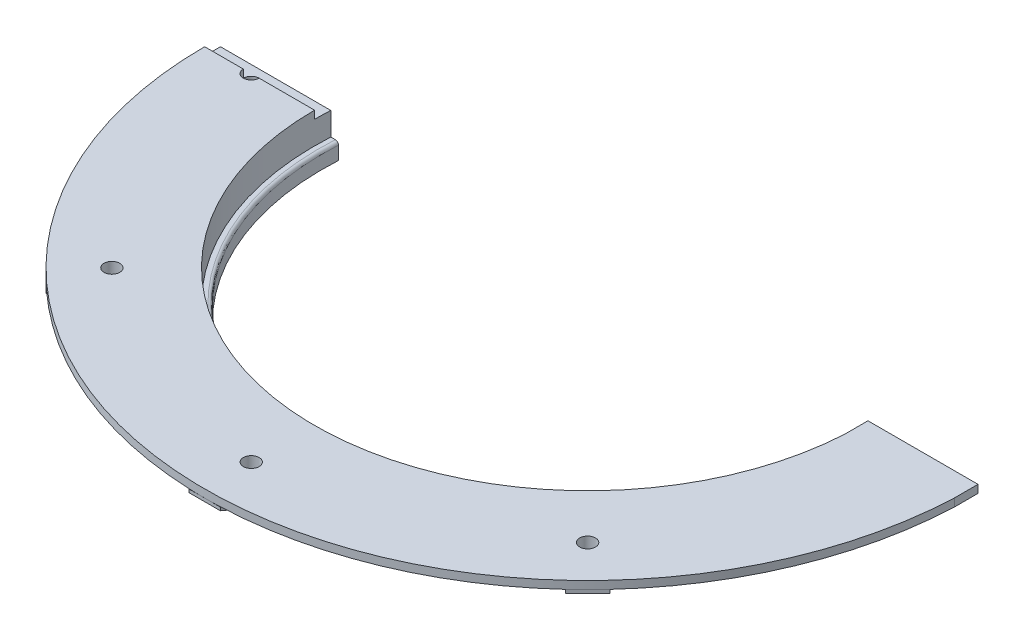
ISO-10303-21;
HEADER;
FILE_DESCRIPTION(('STEP AP214'),'2;1');
FILE_NAME('part.step','',(''),(''),'','','');
FILE_SCHEMA(('AUTOMOTIVE_DESIGN { 1 0 10303 214 1 1 1 1 }'));
ENDSEC;
DATA;
#1=APPLICATION_CONTEXT('core data for automotive mechanical design processes');
#2=APPLICATION_PROTOCOL_DEFINITION('international standard','automotive_design',2000,#1);
#3=PRODUCT_CONTEXT('',#1,'mechanical');
#4=PRODUCT('Part','Part','',(#3));
#5=PRODUCT_RELATED_PRODUCT_CATEGORY('part','',(#4));
#6=PRODUCT_DEFINITION_FORMATION('','',#4);
#7=PRODUCT_DEFINITION_CONTEXT('part definition',#1,'design');
#8=PRODUCT_DEFINITION('design','',#6,#7);
#9=PRODUCT_DEFINITION_SHAPE('','',#8);
#10=(LENGTH_UNIT() NAMED_UNIT(*) SI_UNIT(.MILLI.,.METRE.));
#11=(NAMED_UNIT(*) PLANE_ANGLE_UNIT() SI_UNIT($,.RADIAN.));
#12=(NAMED_UNIT(*) SI_UNIT($,.STERADIAN.) SOLID_ANGLE_UNIT());
#13=UNCERTAINTY_MEASURE_WITH_UNIT(LENGTH_MEASURE(1.E-05),#10,'distance_accuracy_value','');
#14=(GEOMETRIC_REPRESENTATION_CONTEXT(3) GLOBAL_UNCERTAINTY_ASSIGNED_CONTEXT((#13)) GLOBAL_UNIT_ASSIGNED_CONTEXT((#10,
#11,#12)) REPRESENTATION_CONTEXT('',''));
#15=CARTESIAN_POINT('',(0.,0.,0.));
#16=DIRECTION('',(0.,0.,1.));
#17=DIRECTION('',(1.,0.,0.));
#18=AXIS2_PLACEMENT_3D('',#15,#16,#17);
#19=CARTESIAN_POINT('',(-68.5179179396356,25.1460000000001,6.35));
#20=DIRECTION('',(0.,0.,1.));
#21=DIRECTION('',(1.,0.,0.));
#22=AXIS2_PLACEMENT_3D('',#19,#20,#21);
#23=PLANE('',#22);
#24=DIRECTION('',(-1.,0.,0.));
#25=VECTOR('',#24,1.);
#26=CARTESIAN_POINT('',(-68.5179179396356,21.9710000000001,6.35));
#27=LINE('',#26,#25);
#28=CARTESIAN_POINT('',(118.765864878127,21.9710000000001,6.35));
#29=VERTEX_POINT('',#28);
#30=CARTESIAN_POINT('',(109.60771401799,21.9710000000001,6.35));
#31=VERTEX_POINT('',#30);
#32=EDGE_CURVE('E11',#29,#31,#27,.T.);
#33=ORIENTED_EDGE('',*,*,#32,.F.);
#34=DIRECTION('',(0.,-1.,0.));
#35=VECTOR('',#34,1.);
#36=CARTESIAN_POINT('',(118.765864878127,0.,6.35));
#37=LINE('',#36,#35);
#38=CARTESIAN_POINT('',(118.765864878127,6.09600000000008,6.35));
#39=VERTEX_POINT('',#38);
#40=EDGE_CURVE('E683',#29,#39,#37,.T.);
#41=ORIENTED_EDGE('',*,*,#40,.T.);
#42=DIRECTION('',(-1.,0.,0.));
#43=VECTOR('',#42,1.);
#44=CARTESIAN_POINT('',(-68.5179179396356,6.09600000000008,6.35));
#45=LINE('',#44,#43);
#46=CARTESIAN_POINT('',(106.503566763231,6.09600000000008,6.35));
#47=VERTEX_POINT('',#46);
#48=EDGE_CURVE('E329',#39,#47,#45,.T.);
#49=ORIENTED_EDGE('',*,*,#48,.T.);
#50=DIRECTION('',(0.,-1.,0.));
#51=VECTOR('',#50,1.);
#52=CARTESIAN_POINT('',(106.503566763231,0.,6.35));
#53=LINE('',#52,#51);
#54=CARTESIAN_POINT('',(106.503566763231,11.43,6.35));
#55=VERTEX_POINT('',#54);
#56=EDGE_CURVE('E333',#55,#47,#53,.T.);
#57=ORIENTED_EDGE('',*,*,#56,.F.);
#58=CARTESIAN_POINT('',(106.536874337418,11.7186968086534,6.35));
#59=CARTESIAN_POINT('',(106.520660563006,11.6493475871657,6.35));
#60=CARTESIAN_POINT('',(106.510290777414,11.5785789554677,6.35));
#61=CARTESIAN_POINT('',(106.501574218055,11.4362466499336,6.35));
#62=CARTESIAN_POINT('',(106.50324182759,11.3646821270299,6.35));
#63=CARTESIAN_POINT('',(106.518570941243,11.222877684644,6.35));
#64=CARTESIAN_POINT('',(106.532226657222,11.1526371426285,6.35));
#65=CARTESIAN_POINT('',(106.571130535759,11.0154641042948,6.35));
#66=CARTESIAN_POINT('',(106.596375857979,10.9485308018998,6.35));
#67=CARTESIAN_POINT('',(106.657746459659,10.8198219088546,6.35));
#68=CARTESIAN_POINT('',(106.693875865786,10.7580482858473,6.35));
#69=CARTESIAN_POINT('',(106.775981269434,10.641430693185,6.35));
#70=CARTESIAN_POINT('',(106.821957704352,10.5865870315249,6.35));
#71=CARTESIAN_POINT('',(106.922513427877,10.4853105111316,6.35));
#72=CARTESIAN_POINT('',(106.97710385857,10.4388887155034,6.35));
#73=CARTESIAN_POINT('',(107.093292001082,10.3558502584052,6.35));
#74=CARTESIAN_POINT('',(107.154889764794,10.3192336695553,6.35));
#75=CARTESIAN_POINT('',(107.283457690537,10.2567789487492,6.35));
#76=CARTESIAN_POINT('',(107.350436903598,10.2309594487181,6.35));
#77=CARTESIAN_POINT('',(107.48777584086,10.1909146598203,6.35));
#78=CARTESIAN_POINT('',(107.55813558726,10.1766894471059,6.35));
#79=CARTESIAN_POINT('',(107.700340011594,10.1602209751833,6.35));
#80=CARTESIAN_POINT('',(107.772186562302,10.1579938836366,6.35));
#81=CARTESIAN_POINT('',(107.915234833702,10.1656280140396,6.35));
#82=CARTESIAN_POINT('',(107.98643655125,10.1754892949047,6.35));
#83=CARTESIAN_POINT('',(108.126202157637,10.2070298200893,6.35));
#84=CARTESIAN_POINT('',(108.194765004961,10.2287136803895,6.35));
#85=CARTESIAN_POINT('',(108.327273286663,10.2832924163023,6.35));
#86=CARTESIAN_POINT('',(108.391218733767,10.3161872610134,6.35));
#87=CARTESIAN_POINT('',(108.512625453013,10.3922324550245,6.35));
#88=CARTESIAN_POINT('',(108.570091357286,10.4353754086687,6.35));
#89=CARTESIAN_POINT('',(108.676950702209,10.530710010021,6.35));
#90=CARTESIAN_POINT('',(108.726344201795,10.582901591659,6.35));
#91=CARTESIAN_POINT('',(108.815576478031,10.6947688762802,6.35));
#92=CARTESIAN_POINT('',(108.855429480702,10.7544332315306,6.35));
#93=CARTESIAN_POINT('',(108.924533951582,10.8796144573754,6.35));
#94=CARTESIAN_POINT('',(108.953785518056,10.945131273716,6.35));
#95=CARTESIAN_POINT('',(109.000808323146,11.0800431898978,6.35));
#96=CARTESIAN_POINT('',(109.01859812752,11.1494318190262,6.35));
#97=CARTESIAN_POINT('',(109.04226217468,11.2902118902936,6.35));
#98=CARTESIAN_POINT('',(109.048136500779,11.3616033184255,6.35));
#99=CARTESIAN_POINT('',(109.047801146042,11.504282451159,6.35));
#100=CARTESIAN_POINT('',(109.041604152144,11.5755701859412,6.35));
#101=CARTESIAN_POINT('',(109.01732923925,11.7160930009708,6.35));
#102=CARTESIAN_POINT('',(108.99925134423,11.7853280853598,6.35));
#103=CARTESIAN_POINT('',(108.951733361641,11.9197797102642,6.35));
#104=CARTESIAN_POINT('',(108.922293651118,11.9849963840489,6.35));
#105=CARTESIAN_POINT('',(108.852893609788,12.109568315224,6.35));
#106=CARTESIAN_POINT('',(108.812933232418,12.1689235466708,6.35));
#107=CARTESIAN_POINT('',(108.723586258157,12.2801531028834,6.35));
#108=CARTESIAN_POINT('',(108.674190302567,12.3320199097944,6.35));
#109=CARTESIAN_POINT('',(108.567404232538,12.4267406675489,6.35));
#110=CARTESIAN_POINT('',(108.510014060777,12.4695945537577,6.35));
#111=CARTESIAN_POINT('',(108.388770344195,12.5451466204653,6.35));
#112=CARTESIAN_POINT('',(108.324906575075,12.5778283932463,6.35));
#113=CARTESIAN_POINT('',(108.192604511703,12.6320251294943,6.35));
#114=CARTESIAN_POINT('',(108.124166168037,12.6535399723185,6.35));
#115=CARTESIAN_POINT('',(107.984545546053,12.6848238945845,6.35));
#116=CARTESIAN_POINT('',(107.913359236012,12.6945749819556,6.35));
#117=CARTESIAN_POINT('',(107.770359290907,12.701998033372,6.35));
#118=CARTESIAN_POINT('',(107.698545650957,12.6996699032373,6.35));
#119=CARTESIAN_POINT('',(107.556268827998,12.6829931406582,6.35));
#120=CARTESIAN_POINT('',(107.48580678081,12.668634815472,6.35));
#121=CARTESIAN_POINT('',(107.348297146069,12.6282892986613,6.35));
#122=CARTESIAN_POINT('',(107.281249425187,12.6023025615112,6.35));
#123=CARTESIAN_POINT('',(107.152500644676,12.5394460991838,6.35));
#124=CARTESIAN_POINT('',(107.090797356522,12.5025809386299,6.35));
#125=CARTESIAN_POINT('',(106.974450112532,12.418990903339,6.35));
#126=CARTESIAN_POINT('',(106.91980787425,12.3722636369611,6.35));
#127=CARTESIAN_POINT('',(106.8192090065,12.2703290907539,6.35));
#128=CARTESIAN_POINT('',(106.77324528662,12.2151288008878,6.35));
#129=CARTESIAN_POINT('',(106.691304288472,12.0978245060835,6.35));
#130=CARTESIAN_POINT('',(106.655314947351,12.0357289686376,6.35));
#131=CARTESIAN_POINT('',(106.605769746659,11.9307236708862,6.35));
#132=CARTESIAN_POINT('',(106.588863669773,11.8893594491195,6.35));
#133=CARTESIAN_POINT('',(106.559497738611,11.8050816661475,6.35));
#134=CARTESIAN_POINT('',(106.547037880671,11.7621681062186,6.35));
#135=CARTESIAN_POINT('',(106.536874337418,11.7186968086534,6.35));
#136=B_SPLINE_CURVE_WITH_KNOTS('',3,(#58,#59,#60,#61,#62,#63,#64,#65,#66,#67,#68,#69,#70,#71,
#72,#73,#74,#75,#76,#77,#78,#79,#80,#81,#82,#83,#84,#85,#86,#87,#88,#89,#90,#91,#92,#93,#94,#95,
#96,#97,#98,#99,#100,#101,#102,#103,#104,#105,#106,#107,#108,#109,#110,#111,#112,#113,#114,#115,
#116,#117,#118,#119,#120,#121,#122,#123,#124,#125,#126,#127,#128,#129,#130,#131,#132,#133,#134,
#135),.UNSPECIFIED.,.T.,.F.,(4,2,2,2,2,2,2,2,2,2,2,2,2,2,2,2,2,2,2,2,2,2,2,2,2,2,2,2,2,2,2,2,2,
2,2,2,2,2,4),(0.,0.213495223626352,0.427245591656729,0.640892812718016,0.854487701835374,
1.06816367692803,1.28184914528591,1.49581331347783,1.7097790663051,1.92411253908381,
2.13844741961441,2.35307104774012,2.56769572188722,2.78240425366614,2.99711219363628,
3.21166565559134,3.42621755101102,3.64044750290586,3.85467546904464,4.06855555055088,
4.28243413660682,4.49608805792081,4.70974154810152,4.92338794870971,5.13703529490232,
5.35089565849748,5.56475755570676,5.77896264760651,5.99317005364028,6.20770466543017,
6.4222409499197,6.63695025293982,6.85165116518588,7.06626211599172,7.28092517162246,
7.49541207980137,7.7096384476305,7.84346723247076,7.97729590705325),.UNSPECIFIED.);
#137=CARTESIAN_POINT('',(107.775795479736,12.7,6.35));
#138=VERTEX_POINT('',#137);
#139=EDGE_CURVE('E336',#138,#55,#136,.T.);
#140=ORIENTED_EDGE('',*,*,#139,.F.);
#141=DIRECTION('',(-1.,0.,0.));
#142=VECTOR('',#141,1.);
#143=CARTESIAN_POINT('',(-109.791499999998,12.7,6.35));
#144=LINE('',#143,#142);
#145=CARTESIAN_POINT('',(109.60771401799,12.7,6.35));
#146=VERTEX_POINT('',#145);
#147=EDGE_CURVE('E343',#146,#138,#144,.T.);
#148=ORIENTED_EDGE('',*,*,#147,.F.);
#149=DIRECTION('',(0.,-1.,0.));
#150=VECTOR('',#149,1.);
#151=CARTESIAN_POINT('',(109.60771401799,0.,6.35));
#152=LINE('',#151,#150);
#153=EDGE_CURVE('E549',#31,#146,#152,.T.);
#154=ORIENTED_EDGE('',*,*,#153,.F.);
#155=EDGE_LOOP('',(#33,#41,#49,#57,#140,#148,#154));
#156=FACE_BOUND('',#155,.T.);
#157=ADVANCED_FACE('F37',(#156),#23,.F.);
#158=CARTESIAN_POINT('',(0.,0.,-6.35));
#159=DIRECTION('',(0.,0.,1.));
#160=DIRECTION('',(1.,0.,0.));
#161=AXIS2_PLACEMENT_3D('',#158,#159,#160);
#162=PLANE('',#161);
#163=DIRECTION('',(-1.,0.,0.));
#164=VECTOR('',#163,1.);
#165=CARTESIAN_POINT('',(-153.9875,21.9710000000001,-6.35));
#166=LINE('',#165,#164);
#167=CARTESIAN_POINT('',(-109.60771401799,21.9710000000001,-6.35));
#168=VERTEX_POINT('',#167);
#169=CARTESIAN_POINT('',(-153.9875,21.9710000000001,-6.35));
#170=VERTEX_POINT('',#169);
#171=EDGE_CURVE('E690',#168,#170,#166,.T.);
#172=ORIENTED_EDGE('',*,*,#171,.F.);
#173=DIRECTION('',(0.,-1.,0.));
#174=VECTOR('',#173,1.);
#175=CARTESIAN_POINT('',(-109.60771401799,0.,-6.35));
#176=LINE('',#175,#174);
#177=CARTESIAN_POINT('',(-109.60771401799,12.7,-6.35));
#178=VERTEX_POINT('',#177);
#179=EDGE_CURVE('E560',#178,#168,#176,.F.);
#180=ORIENTED_EDGE('',*,*,#179,.F.);
#181=DIRECTION('',(-1.,0.,0.));
#182=VECTOR('',#181,1.);
#183=CARTESIAN_POINT('',(-109.791499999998,12.7,-6.35));
#184=LINE('',#183,#182);
#185=CARTESIAN_POINT('',(-107.775795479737,12.7000000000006,-6.35));
#186=VERTEX_POINT('',#185);
#187=EDGE_CURVE('E557',#186,#178,#184,.T.);
#188=ORIENTED_EDGE('',*,*,#187,.F.);
#189=CARTESIAN_POINT('',(-107.064584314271,12.483014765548,-6.35));
#190=CARTESIAN_POINT('',(-107.123934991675,12.5229566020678,-6.35));
#191=CARTESIAN_POINT('',(-107.186705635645,12.5579109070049,-6.35));
#192=CARTESIAN_POINT('',(-107.317278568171,12.6168105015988,-6.35));
#193=CARTESIAN_POINT('',(-107.38508692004,12.6407422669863,-6.35));
#194=CARTESIAN_POINT('',(-107.523729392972,12.6768733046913,-6.35));
#195=CARTESIAN_POINT('',(-107.594561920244,12.6890786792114,-6.35));
#196=CARTESIAN_POINT('',(-107.737250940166,12.7014281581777,-6.35));
#197=CARTESIAN_POINT('',(-107.809107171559,12.7015752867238,-6.35));
#198=CARTESIAN_POINT('',(-107.951875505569,12.6898090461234,-6.35));
#199=CARTESIAN_POINT('',(-108.02278692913,12.6778874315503,-6.35));
#200=CARTESIAN_POINT('',(-108.16160381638,12.6423047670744,-6.35));
#201=CARTESIAN_POINT('',(-108.229509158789,12.6186432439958,-6.35));
#202=CARTESIAN_POINT('',(-108.360359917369,12.5602552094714,-6.35));
#203=CARTESIAN_POINT('',(-108.42330677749,12.5255319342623,-6.35));
#204=CARTESIAN_POINT('',(-108.54246777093,12.4459979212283,-6.35));
#205=CARTESIAN_POINT('',(-108.598681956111,12.4011872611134,-6.35));
#206=CARTESIAN_POINT('',(-108.702705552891,12.3028081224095,-6.35));
#207=CARTESIAN_POINT('',(-108.750525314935,12.2492505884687,-6.35));
#208=CARTESIAN_POINT('',(-108.836476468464,12.134856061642,-6.35));
#209=CARTESIAN_POINT('',(-108.874607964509,12.074019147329,-6.35));
#210=CARTESIAN_POINT('',(-108.940033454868,11.9469012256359,-6.35));
#211=CARTESIAN_POINT('',(-108.967345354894,11.8806294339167,-6.35));
#212=CARTESIAN_POINT('',(-109.010438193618,11.7444372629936,-6.35));
#213=CARTESIAN_POINT('',(-109.026219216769,11.6745169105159,-6.35));
#214=CARTESIAN_POINT('',(-109.045783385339,11.5331147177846,-6.35));
#215=CARTESIAN_POINT('',(-109.04958284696,11.4616351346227,-6.35));
#216=CARTESIAN_POINT('',(-109.045120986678,11.3190536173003,-6.35));
#217=CARTESIAN_POINT('',(-109.036859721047,11.2479516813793,-6.35));
#218=CARTESIAN_POINT('',(-109.008520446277,11.1081792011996,-6.35));
#219=CARTESIAN_POINT('',(-108.988448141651,11.0395075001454,-6.35));
#220=CARTESIAN_POINT('',(-108.937066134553,10.9065056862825,-6.35));
#221=CARTESIAN_POINT('',(-108.905756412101,10.8421755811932,-6.35));
#222=CARTESIAN_POINT('',(-108.832772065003,10.7196395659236,-6.35));
#223=CARTESIAN_POINT('',(-108.791091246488,10.661437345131,-6.35));
#224=CARTESIAN_POINT('',(-108.69856276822,10.5528439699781,-6.35));
#225=CARTESIAN_POINT('',(-108.647715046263,10.5024528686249,-6.35));
#226=CARTESIAN_POINT('',(-108.538219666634,10.4108341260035,-6.35));
#227=CARTESIAN_POINT('',(-108.479560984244,10.3696196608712,-6.35));
#228=CARTESIAN_POINT('',(-108.356166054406,10.2976046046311,-6.35));
#229=CARTESIAN_POINT('',(-108.291429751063,10.2668041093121,-6.35));
#230=CARTESIAN_POINT('',(-108.157602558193,10.2164389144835,-6.35));
#231=CARTESIAN_POINT('',(-108.08850466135,10.1968928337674,-6.35));
#232=CARTESIAN_POINT('',(-107.948009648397,10.1696635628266,-6.35));
#233=CARTESIAN_POINT('',(-107.876612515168,10.1619804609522,-6.35));
#234=CARTESIAN_POINT('',(-107.733457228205,10.1586904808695,-6.35));
#235=CARTESIAN_POINT('',(-107.661698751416,10.1630976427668,-6.35));
#236=CARTESIAN_POINT('',(-107.519939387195,10.18389436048,-6.35));
#237=CARTESIAN_POINT('',(-107.449938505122,10.2002839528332,-6.35));
#238=CARTESIAN_POINT('',(-107.313671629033,10.2445882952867,-6.35));
#239=CARTESIAN_POINT('',(-107.247406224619,10.2725048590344,-6.35));
#240=CARTESIAN_POINT('',(-107.120508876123,10.3390767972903,-6.35));
#241=CARTESIAN_POINT('',(-107.059876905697,10.3777321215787,-6.35));
#242=CARTESIAN_POINT('',(-106.946030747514,10.4646485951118,-6.35));
#243=CARTESIAN_POINT('',(-106.892809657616,10.5129007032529,-6.35));
#244=CARTESIAN_POINT('',(-106.79523992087,10.6176682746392,-6.35));
#245=CARTESIAN_POINT('',(-106.750891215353,10.6741836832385,-6.35));
#246=CARTESIAN_POINT('',(-106.67240315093,10.7937749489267,-6.35));
#247=CARTESIAN_POINT('',(-106.638247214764,10.8568399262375,-6.35));
#248=CARTESIAN_POINT('',(-106.581027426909,10.987815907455,-6.35));
#249=CARTESIAN_POINT('',(-106.557963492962,11.0557268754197,-6.35));
#250=CARTESIAN_POINT('',(-106.523618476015,11.1943510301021,-6.35));
#251=CARTESIAN_POINT('',(-106.512318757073,11.2650596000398,-6.35));
#252=CARTESIAN_POINT('',(-106.501762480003,11.4073671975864,-6.35));
#253=CARTESIAN_POINT('',(-106.502505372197,11.4789661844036,-6.35));
#254=CARTESIAN_POINT('',(-106.516004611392,11.620952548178,-6.35));
#255=CARTESIAN_POINT('',(-106.528749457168,11.6913410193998,-6.35));
#256=CARTESIAN_POINT('',(-106.565877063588,11.8289989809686,-6.35));
#257=CARTESIAN_POINT('',(-106.590262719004,11.8962676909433,-6.35));
#258=CARTESIAN_POINT('',(-106.649990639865,12.025805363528,-6.35));
#259=CARTESIAN_POINT('',(-106.685341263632,12.0880704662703,-6.35));
#260=CARTESIAN_POINT('',(-106.765960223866,12.2057335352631,-6.35));
#261=CARTESIAN_POINT('',(-106.811216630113,12.261139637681,-6.35));
#262=CARTESIAN_POINT('',(-106.891626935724,12.3442461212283,-6.35));
#263=CARTESIAN_POINT('',(-106.924165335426,12.3745214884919,-6.35));
#264=CARTESIAN_POINT('',(-106.992224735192,12.4315099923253,-6.35));
#265=CARTESIAN_POINT('',(-107.027745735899,12.4582231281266,-6.35));
#266=CARTESIAN_POINT('',(-107.064584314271,12.483014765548,-6.35));
#267=B_SPLINE_CURVE_WITH_KNOTS('',3,(#189,#190,#191,#192,#193,#194,#195,#196,#197,#198,#199,
#200,#201,#202,#203,#204,#205,#206,#207,#208,#209,#210,#211,#212,#213,#214,#215,#216,#217,#218,
#219,#220,#221,#222,#223,#224,#225,#226,#227,#228,#229,#230,#231,#232,#233,#234,#235,#236,#237,
#238,#239,#240,#241,#242,#243,#244,#245,#246,#247,#248,#249,#250,#251,#252,#253,#254,#255,#256,
#257,#258,#259,#260,#261,#262,#263,#264,#265,#266),.UNSPECIFIED.,.T.,.F.,(4,2,2,2,2,2,2,2,2,2,2,
2,2,2,2,2,2,2,2,2,2,2,2,2,2,2,2,2,2,2,2,2,2,2,2,2,2,2,4),(0.,0.214455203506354,0.42917283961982,
0.643778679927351,0.858330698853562,1.07302939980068,1.28773675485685,1.5023813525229,
1.71702429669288,1.93140069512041,2.14577477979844,2.35979259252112,2.57380883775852,
2.78753351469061,3.0012571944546,3.21487773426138,3.4284986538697,3.6422474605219,
3.85599771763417,4.07005293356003,4.28411011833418,4.49852041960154,4.71293231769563,
4.92759331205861,5.14225496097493,5.35695039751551,5.57164483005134,5.78613794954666,
6.00062965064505,6.21477058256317,6.42890992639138,6.64270952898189,6.85649937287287,
7.07008455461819,7.28372287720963,7.497524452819,7.71106993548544,7.84418085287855,
7.97729179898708),.UNSPECIFIED.);
#268=CARTESIAN_POINT('',(-106.503566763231,11.43,-6.35));
#269=VERTEX_POINT('',#268);
#270=EDGE_CURVE('E550',#269,#186,#267,.T.);
#271=ORIENTED_EDGE('',*,*,#270,.F.);
#272=DIRECTION('',(0.,-1.,0.));
#273=VECTOR('',#272,1.);
#274=CARTESIAN_POINT('',(-106.503566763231,0.,-6.35));
#275=LINE('',#274,#273);
#276=CARTESIAN_POINT('',(-106.503566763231,6.09600000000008,-6.35));
#277=VERTEX_POINT('',#276);
#278=EDGE_CURVE('E480',#277,#269,#275,.F.);
#279=ORIENTED_EDGE('',*,*,#278,.F.);
#280=DIRECTION('',(1.,0.,0.));
#281=VECTOR('',#280,1.);
#282=CARTESIAN_POINT('',(-118.935499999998,6.09600000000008,-6.35));
#283=LINE('',#282,#281);
#284=CARTESIAN_POINT('',(-118.935499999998,6.09600000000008,-6.35));
#285=VERTEX_POINT('',#284);
#286=EDGE_CURVE('E703',#285,#277,#283,.T.);
#287=ORIENTED_EDGE('',*,*,#286,.F.);
#288=DIRECTION('',(0.923076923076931,-0.384615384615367,0.));
#289=VECTOR('',#288,1.);
#290=CARTESIAN_POINT('',(-118.935499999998,6.09600000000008,-6.35));
#291=LINE('',#290,#289);
#292=CARTESIAN_POINT('',(-153.9875,20.7010000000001,-6.35));
#293=VERTEX_POINT('',#292);
#294=EDGE_CURVE('E701',#293,#285,#291,.T.);
#295=ORIENTED_EDGE('',*,*,#294,.F.);
#296=DIRECTION('',(0.,-1.,0.));
#297=VECTOR('',#296,1.);
#298=CARTESIAN_POINT('',(-153.9875,21.9710000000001,-6.35));
#299=LINE('',#298,#297);
#300=EDGE_CURVE('E685',#170,#293,#299,.T.);
#301=ORIENTED_EDGE('',*,*,#300,.F.);
#302=EDGE_LOOP('',(#172,#180,#188,#271,#279,#287,#295,#301));
#303=FACE_BOUND('',#302,.T.);
#304=ADVANCED_FACE('F353',(#303),#162,.F.);
#305=CARTESIAN_POINT('',(-118.935499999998,25.1460000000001,0.));
#306=DIRECTION('',(0.,-1.,0.));
#307=DIRECTION('',(0.,0.,-1.));
#308=AXIS2_PLACEMENT_3D('',#305,#306,#307);
#309=PLANE('',#308);
#310=CARTESIAN_POINT('',(95.6397276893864,25.1460000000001,95.6397276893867));
#311=DIRECTION('',(0.,1.,0.));
#312=DIRECTION('',(0.,0.,1.));
#313=AXIS2_PLACEMENT_3D('',#310,#311,#312);
#314=CIRCLE('',#313,3.17499999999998);
#315=CARTESIAN_POINT('',(95.6397276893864,25.1460000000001,98.8147276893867));
#316=VERTEX_POINT('',#315);
#317=EDGE_CURVE('E515',#316,#316,#314,.T.);
#318=ORIENTED_EDGE('',*,*,#317,.F.);
#319=EDGE_LOOP('',(#318));
#320=FACE_BOUND('',#319,.T.);
#321=CARTESIAN_POINT('',(-4.64732147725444E-13,25.1460000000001,135.255));
#322=DIRECTION('',(0.,1.,0.));
#323=DIRECTION('',(0.,0.,1.));
#324=AXIS2_PLACEMENT_3D('',#321,#322,#323);
#325=CIRCLE('',#324,3.17499999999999);
#326=CARTESIAN_POINT('',(-4.64732147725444E-13,25.1460000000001,138.43));
#327=VERTEX_POINT('',#326);
#328=EDGE_CURVE('E519',#327,#327,#325,.T.);
#329=ORIENTED_EDGE('',*,*,#328,.F.);
#330=EDGE_LOOP('',(#329));
#331=FACE_BOUND('',#330,.T.);
#332=CARTESIAN_POINT('',(-95.639727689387,25.1460000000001,95.639727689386));
#333=DIRECTION('',(0.,1.,0.));
#334=DIRECTION('',(0.,0.,1.));
#335=AXIS2_PLACEMENT_3D('',#332,#333,#334);
#336=CIRCLE('',#335,3.17499999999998);
#337=CARTESIAN_POINT('',(-95.639727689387,25.1460000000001,98.814727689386));
#338=VERTEX_POINT('',#337);
#339=EDGE_CURVE('E523',#338,#338,#336,.T.);
#340=ORIENTED_EDGE('',*,*,#339,.F.);
#341=EDGE_LOOP('',(#340));
#342=FACE_BOUND('',#341,.T.);
#343=CARTESIAN_POINT('',(0.,25.1460000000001,0.));
#344=DIRECTION('',(0.,-1.,0.));
#345=DIRECTION('',(0.,0.,-1.));
#346=AXIS2_PLACEMENT_3D('',#343,#344,#345);
#347=CIRCLE('',#346,109.791499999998);
#348=CARTESIAN_POINT('',(109.60771401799,25.1460000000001,6.35));
#349=VERTEX_POINT('',#348);
#350=CARTESIAN_POINT('',(-109.791499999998,25.1460000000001,0.));
#351=VERTEX_POINT('',#350);
#352=EDGE_CURVE('E499',#349,#351,#347,.T.);
#353=ORIENTED_EDGE('',*,*,#352,.T.);
#354=DIRECTION('',(1.,0.,0.));
#355=VECTOR('',#354,1.);
#356=CARTESIAN_POINT('',(-153.9875,25.1460000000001,0.));
#357=LINE('',#356,#355);
#358=CARTESIAN_POINT('',(-132.08,25.1460000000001,0.));
#359=VERTEX_POINT('',#358);
#360=EDGE_CURVE('E316',#359,#351,#357,.T.);
#361=ORIENTED_EDGE('',*,*,#360,.F.);
#362=CARTESIAN_POINT('',(-135.255,25.1460000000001,0.));
#363=DIRECTION('',(0.,1.,0.));
#364=DIRECTION('',(0.,0.,1.));
#365=AXIS2_PLACEMENT_3D('',#362,#363,#364);
#366=CIRCLE('',#365,3.17499999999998);
#367=CARTESIAN_POINT('',(-138.43,25.1460000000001,0.));
#368=VERTEX_POINT('',#367);
#369=EDGE_CURVE('E527',#368,#359,#366,.T.);
#370=ORIENTED_EDGE('',*,*,#369,.F.);
#371=CARTESIAN_POINT('',(-153.9875,25.1460000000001,0.));
#372=VERTEX_POINT('',#371);
#373=EDGE_CURVE('E317',#372,#368,#357,.T.);
#374=ORIENTED_EDGE('',*,*,#373,.F.);
#375=CARTESIAN_POINT('',(0.,25.1460000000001,0.));
#376=DIRECTION('',(0.,-1.,0.));
#377=DIRECTION('',(0.,0.,-1.));
#378=AXIS2_PLACEMENT_3D('',#375,#376,#377);
#379=CIRCLE('',#378,153.9875);
#380=CARTESIAN_POINT('',(153.856516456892,25.1460000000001,6.35));
#381=VERTEX_POINT('',#380);
#382=EDGE_CURVE('E306',#381,#372,#379,.T.);
#383=ORIENTED_EDGE('',*,*,#382,.F.);
#384=DIRECTION('',(0.,0.,-1.));
#385=VECTOR('',#384,1.);
#386=CARTESIAN_POINT('',(153.856516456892,25.1460000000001,6.35));
#387=LINE('',#386,#385);
#388=CARTESIAN_POINT('',(153.856516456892,25.1460000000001,-3.09519534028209));
#389=VERTEX_POINT('',#388);
#390=EDGE_CURVE('E285',#381,#389,#387,.T.);
#391=ORIENTED_EDGE('',*,*,#390,.T.);
#392=DIRECTION('',(-1.,0.,0.));
#393=VECTOR('',#392,1.);
#394=CARTESIAN_POINT('',(153.856516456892,25.1460000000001,-3.09519534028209));
#395=LINE('',#394,#393);
#396=CARTESIAN_POINT('',(109.60771401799,25.1460000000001,-3.09519534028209));
#397=VERTEX_POINT('',#396);
#398=EDGE_CURVE('E294',#389,#397,#395,.T.);
#399=ORIENTED_EDGE('',*,*,#398,.T.);
#400=DIRECTION('',(0.,0.,1.));
#401=VECTOR('',#400,1.);
#402=CARTESIAN_POINT('',(109.60771401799,25.1460000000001,6.35));
#403=LINE('',#402,#401);
#404=EDGE_CURVE('E291',#397,#349,#403,.T.);
#405=ORIENTED_EDGE('',*,*,#404,.T.);
#406=EDGE_LOOP('',(#353,#361,#370,#374,#383,#391,#399,#405));
#407=FACE_BOUND('',#406,.T.);
#408=ADVANCED_FACE('F303',(#320,#331,#342,#407),#309,.F.);
#409=CARTESIAN_POINT('',(-118.935499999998,21.9710000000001,0.));
#410=DIRECTION('',(0.,1.,0.));
#411=DIRECTION('',(0.,0.,1.));
#412=AXIS2_PLACEMENT_3D('',#409,#410,#411);
#413=PLANE('',#412);
#414=DIRECTION('',(-0.707106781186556,0.,0.707106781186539));
#415=VECTOR('',#414,1.);
#416=CARTESIAN_POINT('',(-113.375733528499,21.9710000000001,104.395477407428));
#417=LINE('',#416,#415);
#418=CARTESIAN_POINT('',(-88.4702764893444,21.9710000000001,79.4900203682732));
#419=VERTEX_POINT('',#418);
#420=CARTESIAN_POINT('',(-113.283114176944,21.9710000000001,104.302858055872));
#421=VERTEX_POINT('',#420);
#422=EDGE_CURVE('E574',#419,#421,#417,.T.);
#423=ORIENTED_EDGE('',*,*,#422,.T.);
#424=CARTESIAN_POINT('',(0.,21.9710000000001,0.));
#425=DIRECTION('',(0.,-1.,0.));
#426=DIRECTION('',(0.,0.,-1.));
#427=AXIS2_PLACEMENT_3D('',#424,#425,#426);
#428=CIRCLE('',#427,153.9875);
#429=CARTESIAN_POINT('',(-153.856516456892,21.9710000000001,6.35));
#430=VERTEX_POINT('',#429);
#431=EDGE_CURVE('E502',#421,#430,#428,.T.);
#432=ORIENTED_EDGE('',*,*,#431,.T.);
#433=DIRECTION('',(-1.,0.,0.));
#434=VECTOR('',#433,1.);
#435=CARTESIAN_POINT('',(-153.9875,21.9710000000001,6.35));
#436=LINE('',#435,#434);
#437=CARTESIAN_POINT('',(-118.765864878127,21.9710000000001,6.35));
#438=VERTEX_POINT('',#437);
#439=EDGE_CURVE('E698',#438,#430,#436,.T.);
#440=ORIENTED_EDGE('',*,*,#439,.F.);
#441=CARTESIAN_POINT('',(0.,21.9710000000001,0.));
#442=DIRECTION('',(0.,-1.,0.));
#443=DIRECTION('',(0.,0.,-1.));
#444=AXIS2_PLACEMENT_3D('',#441,#442,#443);
#445=CIRCLE('',#444,118.935499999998);
#446=EDGE_CURVE('E716',#419,#438,#445,.T.);
#447=ORIENTED_EDGE('',*,*,#446,.F.);
#448=EDGE_LOOP('',(#423,#432,#440,#447));
#449=FACE_BOUND('',#448,.T.);
#450=ADVANCED_FACE('F39',(#449),#413,.F.);
#451=CARTESIAN_POINT('',(0.,0.,0.));
#452=DIRECTION('',(0.,-1.,0.));
#453=DIRECTION('',(0.,0.,-1.));
#454=AXIS2_PLACEMENT_3D('',#451,#452,#453);
#455=CYLINDRICAL_SURFACE('',#454,118.935499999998);
#456=DIRECTION('',(0.,-1.,0.));
#457=VECTOR('',#456,1.);
#458=CARTESIAN_POINT('',(-88.4702764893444,0.,79.4900203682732));
#459=LINE('',#458,#457);
#460=CARTESIAN_POINT('',(-88.4702764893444,6.09600000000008,79.4900203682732));
#461=VERTEX_POINT('',#460);
#462=EDGE_CURVE('E60',#419,#461,#459,.T.);
#463=ORIENTED_EDGE('',*,*,#462,.F.);
#464=ORIENTED_EDGE('',*,*,#446,.T.);
#465=DIRECTION('',(0.,-1.,0.));
#466=VECTOR('',#465,1.);
#467=CARTESIAN_POINT('',(-118.765864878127,0.,6.35));
#468=LINE('',#467,#466);
#469=CARTESIAN_POINT('',(-118.765864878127,6.09600000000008,6.35));
#470=VERTEX_POINT('',#469);
#471=EDGE_CURVE('E506',#438,#470,#468,.T.);
#472=ORIENTED_EDGE('',*,*,#471,.T.);
#473=CARTESIAN_POINT('',(0.,6.09600000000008,0.));
#474=DIRECTION('',(0.,-1.,0.));
#475=DIRECTION('',(0.,0.,-1.));
#476=AXIS2_PLACEMENT_3D('',#473,#474,#475);
#477=CIRCLE('',#476,118.935499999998);
#478=EDGE_CURVE('E491',#461,#470,#477,.T.);
#479=ORIENTED_EDGE('',*,*,#478,.F.);
#480=EDGE_LOOP('',(#463,#464,#472,#479));
#481=FACE_BOUND('',#480,.T.);
#482=ADVANCED_FACE('F458',(#481),#455,.T.);
#483=CARTESIAN_POINT('',(-6.35000000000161,21.9710000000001,153.856516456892));
#484=VERTEX_POINT('',#483);
#485=CARTESIAN_POINT('',(-104.302858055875,21.9710000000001,113.283114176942));
#486=VERTEX_POINT('',#485);
#487=EDGE_CURVE('E765',#484,#486,#428,.T.);
#488=ORIENTED_EDGE('',*,*,#487,.T.);
#489=DIRECTION('',(-0.707106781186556,0.,0.707106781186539));
#490=VECTOR('',#489,1.);
#491=CARTESIAN_POINT('',(-104.39547740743,21.9710000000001,113.375733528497));
#492=LINE('',#491,#490);
#493=CARTESIAN_POINT('',(-79.4900203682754,21.9710000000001,88.4702764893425));
#494=VERTEX_POINT('',#493);
#495=EDGE_CURVE('E582',#494,#486,#492,.T.);
#496=ORIENTED_EDGE('',*,*,#495,.F.);
#497=CARTESIAN_POINT('',(-6.35000000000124,21.9710000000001,118.765864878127));
#498=VERTEX_POINT('',#497);
#499=EDGE_CURVE('E717',#498,#494,#445,.T.);
#500=ORIENTED_EDGE('',*,*,#499,.F.);
#501=DIRECTION('',(0.,0.,1.));
#502=VECTOR('',#501,1.);
#503=CARTESIAN_POINT('',(-6.35000000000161,21.9710000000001,153.9875));
#504=LINE('',#503,#502);
#505=EDGE_CURVE('E611',#498,#484,#504,.T.);
#506=ORIENTED_EDGE('',*,*,#505,.T.);
#507=EDGE_LOOP('',(#488,#496,#500,#506));
#508=FACE_BOUND('',#507,.T.);
#509=ADVANCED_FACE('F461',(#508),#413,.F.);
#510=ORIENTED_EDGE('',*,*,#499,.T.);
#511=DIRECTION('',(0.,-1.,0.));
#512=VECTOR('',#511,1.);
#513=CARTESIAN_POINT('',(-79.4900203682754,0.,88.4702764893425));
#514=LINE('',#513,#512);
#515=CARTESIAN_POINT('',(-79.4900203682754,6.09600000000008,88.4702764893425));
#516=VERTEX_POINT('',#515);
#517=EDGE_CURVE('E604',#494,#516,#514,.T.);
#518=ORIENTED_EDGE('',*,*,#517,.T.);
#519=CARTESIAN_POINT('',(-6.35000000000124,6.09600000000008,118.765864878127));
#520=VERTEX_POINT('',#519);
#521=EDGE_CURVE('E727',#520,#516,#477,.T.);
#522=ORIENTED_EDGE('',*,*,#521,.F.);
#523=DIRECTION('',(0.,-1.,0.));
#524=VECTOR('',#523,1.);
#525=CARTESIAN_POINT('',(-6.35000000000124,0.,118.765864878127));
#526=LINE('',#525,#524);
#527=EDGE_CURVE('E639',#498,#520,#526,.T.);
#528=ORIENTED_EDGE('',*,*,#527,.F.);
#529=EDGE_LOOP('',(#510,#518,#522,#528));
#530=FACE_BOUND('',#529,.T.);
#531=ADVANCED_FACE('F462',(#530),#455,.T.);
#532=CARTESIAN_POINT('',(104.302858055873,21.9710000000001,113.283114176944));
#533=VERTEX_POINT('',#532);
#534=CARTESIAN_POINT('',(6.34999999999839,21.9710000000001,153.856516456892));
#535=VERTEX_POINT('',#534);
#536=EDGE_CURVE('E778',#533,#535,#428,.T.);
#537=ORIENTED_EDGE('',*,*,#536,.T.);
#538=DIRECTION('',(0.,0.,1.));
#539=VECTOR('',#538,1.);
#540=CARTESIAN_POINT('',(6.34999999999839,21.9710000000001,153.9875));
#541=LINE('',#540,#539);
#542=CARTESIAN_POINT('',(6.34999999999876,21.9710000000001,118.765864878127));
#543=VERTEX_POINT('',#542);
#544=EDGE_CURVE('E618',#543,#535,#541,.T.);
#545=ORIENTED_EDGE('',*,*,#544,.F.);
#546=CARTESIAN_POINT('',(79.4900203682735,21.9710000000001,88.4702764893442));
#547=VERTEX_POINT('',#546);
#548=EDGE_CURVE('E721',#547,#543,#445,.T.);
#549=ORIENTED_EDGE('',*,*,#548,.F.);
#550=DIRECTION('',(0.707106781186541,0.,0.707106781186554));
#551=VECTOR('',#550,1.);
#552=CARTESIAN_POINT('',(104.395477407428,21.9710000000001,113.375733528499));
#553=LINE('',#552,#551);
#554=EDGE_CURVE('E649',#547,#533,#553,.T.);
#555=ORIENTED_EDGE('',*,*,#554,.T.);
#556=EDGE_LOOP('',(#537,#545,#549,#555));
#557=FACE_BOUND('',#556,.T.);
#558=ADVANCED_FACE('F967',(#557),#413,.F.);
#559=ORIENTED_EDGE('',*,*,#548,.T.);
#560=DIRECTION('',(0.,-1.,0.));
#561=VECTOR('',#560,1.);
#562=CARTESIAN_POINT('',(6.34999999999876,0.,118.765864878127));
#563=LINE('',#562,#561);
#564=CARTESIAN_POINT('',(6.34999999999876,6.09600000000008,118.765864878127));
#565=VERTEX_POINT('',#564);
#566=EDGE_CURVE('E642',#543,#565,#563,.T.);
#567=ORIENTED_EDGE('',*,*,#566,.T.);
#568=CARTESIAN_POINT('',(79.4900203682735,6.09600000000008,88.4702764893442));
#569=VERTEX_POINT('',#568);
#570=EDGE_CURVE('E489',#569,#565,#477,.T.);
#571=ORIENTED_EDGE('',*,*,#570,.F.);
#572=DIRECTION('',(0.,-1.,0.));
#573=VECTOR('',#572,1.);
#574=CARTESIAN_POINT('',(79.4900203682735,0.,88.4702764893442));
#575=LINE('',#574,#573);
#576=EDGE_CURVE('E678',#547,#569,#575,.T.);
#577=ORIENTED_EDGE('',*,*,#576,.F.);
#578=EDGE_LOOP('',(#559,#567,#571,#577));
#579=FACE_BOUND('',#578,.T.);
#580=ADVANCED_FACE('F732',(#579),#455,.T.);
#581=CARTESIAN_POINT('',(153.856516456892,21.9710000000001,6.35));
#582=VERTEX_POINT('',#581);
#583=CARTESIAN_POINT('',(113.283114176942,21.9710000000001,104.302858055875));
#584=VERTEX_POINT('',#583);
#585=EDGE_CURVE('E507',#582,#584,#428,.T.);
#586=ORIENTED_EDGE('',*,*,#585,.T.);
#587=DIRECTION('',(0.707106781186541,0.,0.707106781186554));
#588=VECTOR('',#587,1.);
#589=CARTESIAN_POINT('',(113.375733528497,21.9710000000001,104.39547740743));
#590=LINE('',#589,#588);
#591=CARTESIAN_POINT('',(88.4702764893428,21.9710000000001,79.4900203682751));
#592=VERTEX_POINT('',#591);
#593=EDGE_CURVE('E657',#592,#584,#590,.T.);
#594=ORIENTED_EDGE('',*,*,#593,.F.);
#595=EDGE_CURVE('E718',#29,#592,#445,.T.);
#596=ORIENTED_EDGE('',*,*,#595,.F.);
#597=ORIENTED_EDGE('',*,*,#32,.T.);
#598=DIRECTION('',(0.,0.,-1.));
#599=VECTOR('',#598,1.);
#600=CARTESIAN_POINT('',(109.60771401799,21.9710000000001,6.35));
#601=LINE('',#600,#599);
#602=CARTESIAN_POINT('',(109.60771401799,21.9710000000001,-3.09519534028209));
#603=VERTEX_POINT('',#602);
#604=EDGE_CURVE('E312',#31,#603,#601,.T.);
#605=ORIENTED_EDGE('',*,*,#604,.T.);
#606=DIRECTION('',(1.,0.,0.));
#607=VECTOR('',#606,1.);
#608=CARTESIAN_POINT('',(153.856516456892,21.9710000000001,-3.09519534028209));
#609=LINE('',#608,#607);
#610=CARTESIAN_POINT('',(153.856516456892,21.9710000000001,-3.09519534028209));
#611=VERTEX_POINT('',#610);
#612=EDGE_CURVE('E314',#603,#611,#609,.T.);
#613=ORIENTED_EDGE('',*,*,#612,.T.);
#614=DIRECTION('',(0.,0.,1.));
#615=VECTOR('',#614,1.);
#616=CARTESIAN_POINT('',(153.856516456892,21.9710000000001,6.35));
#617=LINE('',#616,#615);
#618=EDGE_CURVE('E287',#611,#582,#617,.T.);
#619=ORIENTED_EDGE('',*,*,#618,.T.);
#620=EDGE_LOOP('',(#586,#594,#596,#597,#605,#613,#619));
#621=FACE_BOUND('',#620,.T.);
#622=ADVANCED_FACE('F793',(#621),#413,.F.);
#623=ORIENTED_EDGE('',*,*,#595,.T.);
#624=DIRECTION('',(0.,-1.,0.));
#625=VECTOR('',#624,1.);
#626=CARTESIAN_POINT('',(88.4702764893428,0.,79.4900203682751));
#627=LINE('',#626,#625);
#628=CARTESIAN_POINT('',(88.4702764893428,6.09600000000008,79.4900203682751));
#629=VERTEX_POINT('',#628);
#630=EDGE_CURVE('E681',#592,#629,#627,.T.);
#631=ORIENTED_EDGE('',*,*,#630,.T.);
#632=EDGE_CURVE('E484',#39,#629,#477,.T.);
#633=ORIENTED_EDGE('',*,*,#632,.F.);
#634=ORIENTED_EDGE('',*,*,#40,.F.);
#635=EDGE_LOOP('',(#623,#631,#633,#634));
#636=FACE_BOUND('',#635,.T.);
#637=ADVANCED_FACE('F463',(#636),#455,.T.);
#638=CARTESIAN_POINT('',(0.,0.,0.));
#639=DIRECTION('',(0.,-1.,0.));
#640=DIRECTION('',(0.,0.,-1.));
#641=AXIS2_PLACEMENT_3D('',#638,#639,#640);
#642=CYLINDRICAL_SURFACE('',#641,153.9875);
#643=ORIENTED_EDGE('',*,*,#382,.T.);
#644=DIRECTION('',(0.,1.,0.));
#645=VECTOR('',#644,1.);
#646=CARTESIAN_POINT('',(-153.9875,-25.9356427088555,0.));
#647=LINE('',#646,#645);
#648=CARTESIAN_POINT('',(-153.9875,21.9710000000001,0.));
#649=VERTEX_POINT('',#648);
#650=EDGE_CURVE('E319',#649,#372,#647,.T.);
#651=ORIENTED_EDGE('',*,*,#650,.F.);
#652=EDGE_CURVE('E503',#430,#649,#428,.T.);
#653=ORIENTED_EDGE('',*,*,#652,.F.);
#654=ORIENTED_EDGE('',*,*,#431,.F.);
#655=CARTESIAN_POINT('',(-108.885605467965,21.9710000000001,108.885605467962));
#656=VERTEX_POINT('',#655);
#657=EDGE_CURVE('E761',#656,#421,#428,.T.);
#658=ORIENTED_EDGE('',*,*,#657,.F.);
#659=EDGE_CURVE('E764',#486,#656,#428,.T.);
#660=ORIENTED_EDGE('',*,*,#659,.F.);
#661=ORIENTED_EDGE('',*,*,#487,.F.);
#662=CARTESIAN_POINT('',(-1.61293344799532E-12,21.9710000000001,153.9875));
#663=VERTEX_POINT('',#662);
#664=EDGE_CURVE('E769',#663,#484,#428,.T.);
#665=ORIENTED_EDGE('',*,*,#664,.F.);
#666=EDGE_CURVE('E773',#535,#663,#428,.T.);
#667=ORIENTED_EDGE('',*,*,#666,.F.);
#668=ORIENTED_EDGE('',*,*,#536,.F.);
#669=CARTESIAN_POINT('',(108.885605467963,21.9710000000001,108.885605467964));
#670=VERTEX_POINT('',#669);
#671=EDGE_CURVE('E782',#670,#533,#428,.T.);
#672=ORIENTED_EDGE('',*,*,#671,.F.);
#673=EDGE_CURVE('E784',#584,#670,#428,.T.);
#674=ORIENTED_EDGE('',*,*,#673,.F.);
#675=ORIENTED_EDGE('',*,*,#585,.F.);
#676=DIRECTION('',(0.,-1.,0.));
#677=VECTOR('',#676,1.);
#678=CARTESIAN_POINT('',(153.856516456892,0.,6.35));
#679=LINE('',#678,#677);
#680=EDGE_CURVE('E331',#582,#381,#679,.F.);
#681=ORIENTED_EDGE('',*,*,#680,.T.);
#682=EDGE_LOOP('',(#643,#651,#653,#654,#658,#660,#661,#665,#667,#668,#672,#674,#675,#681));
#683=FACE_BOUND('',#682,.T.);
#684=ADVANCED_FACE('F1097',(#683),#642,.T.);
#685=CARTESIAN_POINT('',(0.,0.,0.));
#686=DIRECTION('',(0.,-1.,0.));
#687=DIRECTION('',(0.,0.,-1.));
#688=AXIS2_PLACEMENT_3D('',#685,#686,#687);
#689=CYLINDRICAL_SURFACE('',#688,109.791499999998);
#690=CARTESIAN_POINT('',(0.,21.9710000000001,0.));
#691=DIRECTION('',(0.,1.,0.));
#692=DIRECTION('',(0.,0.,1.));
#693=AXIS2_PLACEMENT_3D('',#690,#691,#692);
#694=CIRCLE('',#693,109.791499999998);
#695=CARTESIAN_POINT('',(-109.791499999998,21.9710000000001,0.));
#696=VERTEX_POINT('',#695);
#697=EDGE_CURVE('E323',#696,#168,#694,.F.);
#698=ORIENTED_EDGE('',*,*,#697,.F.);
#699=DIRECTION('',(0.,-1.,0.));
#700=VECTOR('',#699,1.);
#701=CARTESIAN_POINT('',(-109.791499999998,0.,0.));
#702=LINE('',#701,#700);
#703=EDGE_CURVE('E326',#696,#351,#702,.F.);
#704=ORIENTED_EDGE('',*,*,#703,.T.);
#705=ORIENTED_EDGE('',*,*,#352,.F.);
#706=EDGE_CURVE('E544',#349,#31,#152,.T.);
#707=ORIENTED_EDGE('',*,*,#706,.T.);
#708=ORIENTED_EDGE('',*,*,#153,.T.);
#709=CARTESIAN_POINT('',(0.,12.7,0.));
#710=DIRECTION('',(0.,-1.,0.));
#711=DIRECTION('',(0.,0.,-1.));
#712=AXIS2_PLACEMENT_3D('',#709,#710,#711);
#713=CIRCLE('',#712,109.791499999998);
#714=EDGE_CURVE('E496',#146,#178,#713,.T.);
#715=ORIENTED_EDGE('',*,*,#714,.T.);
#716=ORIENTED_EDGE('',*,*,#179,.T.);
#717=EDGE_LOOP('',(#698,#704,#705,#707,#708,#715,#716));
#718=FACE_BOUND('',#717,.T.);
#719=ADVANCED_FACE('F543',(#718),#689,.F.);
#720=CARTESIAN_POINT('',(-109.791499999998,12.7,0.));
#721=DIRECTION('',(0.,-1.,0.));
#722=DIRECTION('',(0.,0.,-1.));
#723=AXIS2_PLACEMENT_3D('',#720,#721,#722);
#724=PLANE('',#723);
#725=CARTESIAN_POINT('',(0.,12.7,0.));
#726=DIRECTION('',(0.,-1.,0.));
#727=DIRECTION('',(0.,0.,-1.));
#728=AXIS2_PLACEMENT_3D('',#725,#726,#727);
#729=CIRCLE('',#728,107.9627);
#730=EDGE_CURVE('E486',#138,#186,#729,.T.);
#731=ORIENTED_EDGE('',*,*,#730,.T.);
#732=ORIENTED_EDGE('',*,*,#187,.T.);
#733=ORIENTED_EDGE('',*,*,#714,.F.);
#734=ORIENTED_EDGE('',*,*,#147,.T.);
#735=EDGE_LOOP('',(#731,#732,#733,#734));
#736=FACE_BOUND('',#735,.T.);
#737=ADVANCED_FACE('F472',(#736),#724,.F.);
#738=CARTESIAN_POINT('',(0.,11.43,0.));
#739=DIRECTION('',(0.,-1.,0.));
#740=DIRECTION('',(0.,0.,-1.));
#741=AXIS2_PLACEMENT_3D('',#738,#739,#740);
#742=TOROIDAL_SURFACE('',#741,107.9627,1.27);
#743=CARTESIAN_POINT('',(0.,11.43,0.));
#744=DIRECTION('',(0.,-1.,0.));
#745=DIRECTION('',(0.,0.,-1.));
#746=AXIS2_PLACEMENT_3D('',#743,#744,#745);
#747=CIRCLE('',#746,106.6927);
#748=EDGE_CURVE('E483',#55,#269,#747,.T.);
#749=ORIENTED_EDGE('',*,*,#748,.T.);
#750=ORIENTED_EDGE('',*,*,#270,.T.);
#751=ORIENTED_EDGE('',*,*,#730,.F.);
#752=ORIENTED_EDGE('',*,*,#139,.T.);
#753=EDGE_LOOP('',(#749,#750,#751,#752));
#754=FACE_BOUND('',#753,.T.);
#755=ADVANCED_FACE('F345',(#754),#742,.T.);
#756=CARTESIAN_POINT('',(0.,0.,0.));
#757=DIRECTION('',(0.,-1.,0.));
#758=DIRECTION('',(0.,0.,-1.));
#759=AXIS2_PLACEMENT_3D('',#756,#757,#758);
#760=CYLINDRICAL_SURFACE('',#759,106.6927);
#761=CARTESIAN_POINT('',(0.,6.09600000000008,0.));
#762=DIRECTION('',(0.,-1.,0.));
#763=DIRECTION('',(0.,0.,-1.));
#764=AXIS2_PLACEMENT_3D('',#761,#762,#763);
#765=CIRCLE('',#764,106.6927);
#766=EDGE_CURVE('E477',#47,#277,#765,.T.);
#767=ORIENTED_EDGE('',*,*,#766,.T.);
#768=ORIENTED_EDGE('',*,*,#278,.T.);
#769=ORIENTED_EDGE('',*,*,#748,.F.);
#770=ORIENTED_EDGE('',*,*,#56,.T.);
#771=EDGE_LOOP('',(#767,#768,#769,#770));
#772=FACE_BOUND('',#771,.T.);
#773=ADVANCED_FACE('F465',(#772),#760,.F.);
#774=CARTESIAN_POINT('',(-118.935499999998,6.09600000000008,0.));
#775=DIRECTION('',(0.,1.,0.));
#776=DIRECTION('',(0.,0.,1.));
#777=AXIS2_PLACEMENT_3D('',#774,#775,#776);
#778=PLANE('',#777);
#779=ORIENTED_EDGE('',*,*,#286,.T.);
#780=ORIENTED_EDGE('',*,*,#766,.F.);
#781=ORIENTED_EDGE('',*,*,#48,.F.);
#782=ORIENTED_EDGE('',*,*,#632,.T.);
#783=DIRECTION('',(-0.707106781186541,0.,-0.707106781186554));
#784=VECTOR('',#783,1.);
#785=CARTESIAN_POINT('',(88.5902266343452,6.09600000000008,79.6099705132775));
#786=LINE('',#785,#784);
#787=CARTESIAN_POINT('',(88.5902266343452,6.09600000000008,79.6099705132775));
#788=VERTEX_POINT('',#787);
#789=EDGE_CURVE('E652',#788,#629,#786,.T.);
#790=ORIENTED_EDGE('',*,*,#789,.F.);
#791=DIRECTION('',(-0.707106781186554,0.,0.707106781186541));
#792=VECTOR('',#791,1.);
#793=CARTESIAN_POINT('',(88.5902266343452,6.09600000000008,79.6099705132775));
#794=LINE('',#793,#792);
#795=CARTESIAN_POINT('',(79.6099705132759,6.09600000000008,88.5902266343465));
#796=VERTEX_POINT('',#795);
#797=EDGE_CURVE('E672',#788,#796,#794,.T.);
#798=ORIENTED_EDGE('',*,*,#797,.T.);
#799=DIRECTION('',(-0.707106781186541,0.,-0.707106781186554));
#800=VECTOR('',#799,1.);
#801=CARTESIAN_POINT('',(79.6099705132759,6.09600000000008,88.5902266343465));
#802=LINE('',#801,#800);
#803=EDGE_CURVE('E663',#796,#569,#802,.T.);
#804=ORIENTED_EDGE('',*,*,#803,.T.);
#805=ORIENTED_EDGE('',*,*,#570,.T.);
#806=DIRECTION('',(0.,0.,-1.));
#807=VECTOR('',#806,1.);
#808=CARTESIAN_POINT('',(6.34999999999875,6.09600000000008,118.935499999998));
#809=LINE('',#808,#807);
#810=CARTESIAN_POINT('',(6.34999999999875,6.09600000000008,118.935499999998));
#811=VERTEX_POINT('',#810);
#812=EDGE_CURVE('E613',#811,#565,#809,.T.);
#813=ORIENTED_EDGE('',*,*,#812,.F.);
#814=DIRECTION('',(-1.,0.,0.));
#815=VECTOR('',#814,1.);
#816=CARTESIAN_POINT('',(6.34999999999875,6.09600000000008,118.935499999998));
#817=LINE('',#816,#815);
#818=CARTESIAN_POINT('',(-6.35000000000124,6.09600000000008,118.935499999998));
#819=VERTEX_POINT('',#818);
#820=EDGE_CURVE('E633',#811,#819,#817,.T.);
#821=ORIENTED_EDGE('',*,*,#820,.T.);
#822=DIRECTION('',(0.,0.,-1.));
#823=VECTOR('',#822,1.);
#824=CARTESIAN_POINT('',(-6.35000000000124,6.09600000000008,118.935499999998));
#825=LINE('',#824,#823);
#826=EDGE_CURVE('E624',#819,#520,#825,.T.);
#827=ORIENTED_EDGE('',*,*,#826,.T.);
#828=ORIENTED_EDGE('',*,*,#521,.T.);
#829=DIRECTION('',(0.707106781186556,0.,-0.707106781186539));
#830=VECTOR('',#829,1.);
#831=CARTESIAN_POINT('',(-79.6099705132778,6.09600000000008,88.5902266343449));
#832=LINE('',#831,#830);
#833=CARTESIAN_POINT('',(-79.6099705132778,6.09600000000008,88.5902266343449));
#834=VERTEX_POINT('',#833);
#835=EDGE_CURVE('E577',#834,#516,#832,.T.);
#836=ORIENTED_EDGE('',*,*,#835,.F.);
#837=DIRECTION('',(-0.707106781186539,0.,-0.707106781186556));
#838=VECTOR('',#837,1.);
#839=CARTESIAN_POINT('',(-79.6099705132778,6.09600000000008,88.5902266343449));
#840=LINE('',#839,#838);
#841=CARTESIAN_POINT('',(-88.5902266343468,6.09600000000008,79.6099705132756));
#842=VERTEX_POINT('',#841);
#843=EDGE_CURVE('E597',#834,#842,#840,.T.);
#844=ORIENTED_EDGE('',*,*,#843,.T.);
#845=DIRECTION('',(0.707106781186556,0.,-0.707106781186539));
#846=VECTOR('',#845,1.);
#847=CARTESIAN_POINT('',(-88.5902266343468,6.09600000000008,79.6099705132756));
#848=LINE('',#847,#846);
#849=EDGE_CURVE('E588',#842,#461,#848,.T.);
#850=ORIENTED_EDGE('',*,*,#849,.T.);
#851=ORIENTED_EDGE('',*,*,#478,.T.);
#852=DIRECTION('',(1.,0.,0.));
#853=VECTOR('',#852,1.);
#854=CARTESIAN_POINT('',(-118.935499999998,6.09600000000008,6.35));
#855=LINE('',#854,#853);
#856=CARTESIAN_POINT('',(-118.935499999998,6.09600000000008,6.35));
#857=VERTEX_POINT('',#856);
#858=EDGE_CURVE('E693',#857,#470,#855,.T.);
#859=ORIENTED_EDGE('',*,*,#858,.F.);
#860=DIRECTION('',(0.,0.,-1.));
#861=VECTOR('',#860,1.);
#862=CARTESIAN_POINT('',(-118.935499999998,6.09600000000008,6.35));
#863=LINE('',#862,#861);
#864=EDGE_CURVE('E710',#857,#285,#863,.T.);
#865=ORIENTED_EDGE('',*,*,#864,.T.);
#866=EDGE_LOOP('',(#779,#780,#781,#782,#790,#798,#804,#805,#813,#821,#827,#828,#836,#844,#850,
#851,#859,#865));
#867=FACE_BOUND('',#866,.T.);
#868=ADVANCED_FACE('F450',(#867),#778,.F.);
#869=CARTESIAN_POINT('',(-153.9875,21.9710000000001,6.35));
#870=DIRECTION('',(0.,-1.,0.));
#871=DIRECTION('',(1.,0.,0.));
#872=AXIS2_PLACEMENT_3D('',#869,#870,#871);
#873=PLANE('',#872);
#874=CARTESIAN_POINT('',(-153.9875,21.9710000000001,6.35));
#875=VERTEX_POINT('',#874);
#876=EDGE_CURVE('E696',#430,#875,#436,.T.);
#877=ORIENTED_EDGE('',*,*,#876,.F.);
#878=ORIENTED_EDGE('',*,*,#652,.T.);
#879=DIRECTION('',(0.,0.,-1.));
#880=VECTOR('',#879,1.);
#881=CARTESIAN_POINT('',(-153.9875,21.9710000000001,6.35));
#882=LINE('',#881,#880);
#883=EDGE_CURVE('E707',#875,#649,#882,.T.);
#884=ORIENTED_EDGE('',*,*,#883,.F.);
#885=EDGE_LOOP('',(#877,#878,#884));
#886=FACE_BOUND('',#885,.T.);
#887=ADVANCED_FACE('F447',(#886),#873,.F.);
#888=EDGE_CURVE('E711',#649,#170,#882,.T.);
#889=ORIENTED_EDGE('',*,*,#888,.F.);
#890=DIRECTION('',(-1.,0.,0.));
#891=VECTOR('',#890,1.);
#892=CARTESIAN_POINT('',(-153.9875,21.9710000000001,0.));
#893=LINE('',#892,#891);
#894=CARTESIAN_POINT('',(-138.43,21.9710000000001,0.));
#895=VERTEX_POINT('',#894);
#896=EDGE_CURVE('E52',#895,#649,#893,.T.);
#897=ORIENTED_EDGE('',*,*,#896,.F.);
#898=CARTESIAN_POINT('',(-135.255,21.9710000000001,0.));
#899=DIRECTION('',(0.,1.,0.));
#900=DIRECTION('',(0.,0.,1.));
#901=AXIS2_PLACEMENT_3D('',#898,#899,#900);
#902=CIRCLE('',#901,3.175);
#903=CARTESIAN_POINT('',(-132.08,21.9710000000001,0.));
#904=VERTEX_POINT('',#903);
#905=EDGE_CURVE('E510',#895,#904,#902,.F.);
#906=ORIENTED_EDGE('',*,*,#905,.T.);
#907=EDGE_CURVE('E322',#696,#904,#893,.T.);
#908=ORIENTED_EDGE('',*,*,#907,.F.);
#909=ORIENTED_EDGE('',*,*,#697,.T.);
#910=ORIENTED_EDGE('',*,*,#171,.T.);
#911=EDGE_LOOP('',(#889,#897,#906,#908,#909,#910));
#912=FACE_BOUND('',#911,.T.);
#913=ADVANCED_FACE('F442',(#912),#873,.F.);
#914=CARTESIAN_POINT('',(0.,0.,6.35));
#915=DIRECTION('',(0.,0.,1.));
#916=DIRECTION('',(1.,0.,0.));
#917=AXIS2_PLACEMENT_3D('',#914,#915,#916);
#918=PLANE('',#917);
#919=ORIENTED_EDGE('',*,*,#471,.F.);
#920=ORIENTED_EDGE('',*,*,#439,.T.);
#921=ORIENTED_EDGE('',*,*,#876,.T.);
#922=DIRECTION('',(0.,-1.,0.));
#923=VECTOR('',#922,1.);
#924=CARTESIAN_POINT('',(-153.9875,21.9710000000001,6.35));
#925=LINE('',#924,#923);
#926=CARTESIAN_POINT('',(-153.9875,20.7010000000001,6.35));
#927=VERTEX_POINT('',#926);
#928=EDGE_CURVE('E686',#875,#927,#925,.T.);
#929=ORIENTED_EDGE('',*,*,#928,.T.);
#930=DIRECTION('',(0.923076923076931,-0.384615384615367,0.));
#931=VECTOR('',#930,1.);
#932=CARTESIAN_POINT('',(-118.935499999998,6.09600000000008,6.35));
#933=LINE('',#932,#931);
#934=EDGE_CURVE('E689',#927,#857,#933,.T.);
#935=ORIENTED_EDGE('',*,*,#934,.T.);
#936=ORIENTED_EDGE('',*,*,#858,.T.);
#937=EDGE_LOOP('',(#919,#920,#921,#929,#935,#936));
#938=FACE_BOUND('',#937,.T.);
#939=ADVANCED_FACE('F438',(#938),#918,.T.);
#940=CARTESIAN_POINT('',(-153.9875,21.9710000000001,6.35));
#941=DIRECTION('',(1.,0.,0.));
#942=DIRECTION('',(0.,0.,-1.));
#943=AXIS2_PLACEMENT_3D('',#940,#941,#942);
#944=PLANE('',#943);
#945=ORIENTED_EDGE('',*,*,#300,.T.);
#946=DIRECTION('',(0.,0.,-1.));
#947=VECTOR('',#946,1.);
#948=CARTESIAN_POINT('',(-153.9875,20.7010000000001,6.35));
#949=LINE('',#948,#947);
#950=EDGE_CURVE('E714',#927,#293,#949,.T.);
#951=ORIENTED_EDGE('',*,*,#950,.F.);
#952=ORIENTED_EDGE('',*,*,#928,.F.);
#953=ORIENTED_EDGE('',*,*,#883,.T.);
#954=ORIENTED_EDGE('',*,*,#888,.T.);
#955=EDGE_LOOP('',(#945,#951,#952,#953,#954));
#956=FACE_BOUND('',#955,.T.);
#957=ADVANCED_FACE('F441',(#956),#944,.F.);
#958=CARTESIAN_POINT('',(-118.935499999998,6.09600000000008,6.35));
#959=DIRECTION('',(0.384615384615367,0.92307692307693,0.));
#960=DIRECTION('',(-0.92307692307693,0.384615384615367,0.));
#961=AXIS2_PLACEMENT_3D('',#958,#959,#960);
#962=PLANE('',#961);
#963=CARTESIAN_POINT('',(-135.255,12.8957916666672,0.));
#964=DIRECTION('',(0.384615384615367,0.92307692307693,0.));
#965=DIRECTION('',(-0.92307692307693,0.384615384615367,0.));
#966=AXIS2_PLACEMENT_3D('',#963,#964,#965);
#967=ELLIPSE('',#966,3.4395833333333,3.175);
#968=CARTESIAN_POINT('',(-138.43,14.2187083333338,0.));
#969=VERTEX_POINT('',#968);
#970=EDGE_CURVE('E524',#969,#969,#967,.T.);
#971=ORIENTED_EDGE('',*,*,#970,.T.);
#972=EDGE_LOOP('',(#971));
#973=FACE_BOUND('',#972,.T.);
#974=ORIENTED_EDGE('',*,*,#294,.T.);
#975=ORIENTED_EDGE('',*,*,#864,.F.);
#976=ORIENTED_EDGE('',*,*,#934,.F.);
#977=ORIENTED_EDGE('',*,*,#950,.T.);
#978=EDGE_LOOP('',(#974,#975,#976,#977));
#979=FACE_BOUND('',#978,.T.);
#980=ADVANCED_FACE('F430',(#973,#979),#962,.F.);
#981=CARTESIAN_POINT('',(113.375733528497,21.9710000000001,104.39547740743));
#982=DIRECTION('',(0.,-1.,0.));
#983=DIRECTION('',(0.,0.,-1.));
#984=AXIS2_PLACEMENT_3D('',#981,#982,#983);
#985=PLANE('',#984);
#986=CARTESIAN_POINT('',(113.375733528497,21.9710000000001,104.39547740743));
#987=VERTEX_POINT('',#986);
#988=EDGE_CURVE('E655',#584,#987,#590,.T.);
#989=ORIENTED_EDGE('',*,*,#988,.F.);
#990=ORIENTED_EDGE('',*,*,#673,.T.);
#991=DIRECTION('',(-0.707106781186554,0.,0.707106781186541));
#992=VECTOR('',#991,1.);
#993=CARTESIAN_POINT('',(113.375733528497,21.9710000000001,104.39547740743));
#994=LINE('',#993,#992);
#995=EDGE_CURVE('E669',#987,#670,#994,.T.);
#996=ORIENTED_EDGE('',*,*,#995,.F.);
#997=EDGE_LOOP('',(#989,#990,#996));
#998=FACE_BOUND('',#997,.T.);
#999=ADVANCED_FACE('F427',(#998),#985,.F.);
#1000=CARTESIAN_POINT('',(104.395477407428,21.9710000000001,113.375733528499));
#1001=VERTEX_POINT('',#1000);
#1002=EDGE_CURVE('E673',#670,#1001,#994,.T.);
#1003=ORIENTED_EDGE('',*,*,#1002,.F.);
#1004=ORIENTED_EDGE('',*,*,#671,.T.);
#1005=EDGE_CURVE('E666',#533,#1001,#553,.T.);
#1006=ORIENTED_EDGE('',*,*,#1005,.T.);
#1007=EDGE_LOOP('',(#1003,#1004,#1006));
#1008=FACE_BOUND('',#1007,.T.);
#1009=ADVANCED_FACE('F421',(#1008),#985,.F.);
#1010=CARTESIAN_POINT('',(4.49012806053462,0.,-4.49012806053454));
#1011=DIRECTION('',(0.707106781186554,0.,-0.707106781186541));
#1012=DIRECTION('',(-0.707106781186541,0.,-0.707106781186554));
#1013=AXIS2_PLACEMENT_3D('',#1010,#1011,#1012);
#1014=PLANE('',#1013);
#1015=ORIENTED_EDGE('',*,*,#630,.F.);
#1016=ORIENTED_EDGE('',*,*,#593,.T.);
#1017=ORIENTED_EDGE('',*,*,#988,.T.);
#1018=DIRECTION('',(0.,-1.,0.));
#1019=VECTOR('',#1018,1.);
#1020=CARTESIAN_POINT('',(113.375733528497,21.9710000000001,104.39547740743));
#1021=LINE('',#1020,#1019);
#1022=CARTESIAN_POINT('',(113.375733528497,20.7010000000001,104.39547740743));
#1023=VERTEX_POINT('',#1022);
#1024=EDGE_CURVE('E645',#987,#1023,#1021,.T.);
#1025=ORIENTED_EDGE('',*,*,#1024,.T.);
#1026=DIRECTION('',(-0.652713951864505,-0.384615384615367,-0.652713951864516));
#1027=VECTOR('',#1026,1.);
#1028=CARTESIAN_POINT('',(88.5902266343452,6.09600000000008,79.6099705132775));
#1029=LINE('',#1028,#1027);
#1030=EDGE_CURVE('E648',#1023,#788,#1029,.T.);
#1031=ORIENTED_EDGE('',*,*,#1030,.T.);
#1032=ORIENTED_EDGE('',*,*,#789,.T.);
#1033=EDGE_LOOP('',(#1015,#1016,#1017,#1025,#1031,#1032));
#1034=FACE_BOUND('',#1033,.T.);
#1035=ADVANCED_FACE('F417',(#1034),#1014,.T.);
#1036=CARTESIAN_POINT('',(-4.49012806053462,0.,4.49012806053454));
#1037=DIRECTION('',(0.707106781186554,0.,-0.707106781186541));
#1038=DIRECTION('',(-0.707106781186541,0.,-0.707106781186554));
#1039=AXIS2_PLACEMENT_3D('',#1036,#1037,#1038);
#1040=PLANE('',#1039);
#1041=ORIENTED_EDGE('',*,*,#554,.F.);
#1042=ORIENTED_EDGE('',*,*,#576,.T.);
#1043=ORIENTED_EDGE('',*,*,#803,.F.);
#1044=DIRECTION('',(-0.652713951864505,-0.384615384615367,-0.652713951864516));
#1045=VECTOR('',#1044,1.);
#1046=CARTESIAN_POINT('',(79.6099705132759,6.09600000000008,88.5902266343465));
#1047=LINE('',#1046,#1045);
#1048=CARTESIAN_POINT('',(104.395477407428,20.7010000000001,113.375733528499));
#1049=VERTEX_POINT('',#1048);
#1050=EDGE_CURVE('E660',#1049,#796,#1047,.T.);
#1051=ORIENTED_EDGE('',*,*,#1050,.F.);
#1052=DIRECTION('',(0.,-1.,0.));
#1053=VECTOR('',#1052,1.);
#1054=CARTESIAN_POINT('',(104.395477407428,21.9710000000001,113.375733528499));
#1055=LINE('',#1054,#1053);
#1056=EDGE_CURVE('E644',#1001,#1049,#1055,.T.);
#1057=ORIENTED_EDGE('',*,*,#1056,.F.);
#1058=ORIENTED_EDGE('',*,*,#1005,.F.);
#1059=EDGE_LOOP('',(#1041,#1042,#1043,#1051,#1057,#1058));
#1060=FACE_BOUND('',#1059,.T.);
#1061=ADVANCED_FACE('F420',(#1060),#1040,.F.);
#1062=CARTESIAN_POINT('',(113.375733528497,21.9710000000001,104.39547740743));
#1063=DIRECTION('',(-0.707106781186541,0.,-0.707106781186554));
#1064=DIRECTION('',(-0.707106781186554,0.,0.707106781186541));
#1065=AXIS2_PLACEMENT_3D('',#1062,#1063,#1064);
#1066=PLANE('',#1065);
#1067=ORIENTED_EDGE('',*,*,#1056,.T.);
#1068=DIRECTION('',(-0.707106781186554,0.,0.707106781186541));
#1069=VECTOR('',#1068,1.);
#1070=CARTESIAN_POINT('',(113.375733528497,20.7010000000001,104.39547740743));
#1071=LINE('',#1070,#1069);
#1072=EDGE_CURVE('E675',#1023,#1049,#1071,.T.);
#1073=ORIENTED_EDGE('',*,*,#1072,.F.);
#1074=ORIENTED_EDGE('',*,*,#1024,.F.);
#1075=ORIENTED_EDGE('',*,*,#995,.T.);
#1076=ORIENTED_EDGE('',*,*,#1002,.T.);
#1077=EDGE_LOOP('',(#1067,#1073,#1074,#1075,#1076));
#1078=FACE_BOUND('',#1077,.T.);
#1079=ADVANCED_FACE('F425',(#1078),#1066,.F.);
#1080=CARTESIAN_POINT('',(88.5902266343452,6.09600000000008,79.6099705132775));
#1081=DIRECTION('',(-0.271964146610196,0.923076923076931,-0.2719641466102));
#1082=DIRECTION('',(0.,0.282616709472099,0.959232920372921));
#1083=AXIS2_PLACEMENT_3D('',#1080,#1081,#1082);
#1084=PLANE('',#1083);
#1085=CARTESIAN_POINT('',(95.6397276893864,12.8957916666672,95.6397276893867));
#1086=DIRECTION('',(-0.271964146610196,0.923076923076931,-0.2719641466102));
#1087=DIRECTION('',(0.652713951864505,0.384615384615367,0.652713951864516));
#1088=AXIS2_PLACEMENT_3D('',#1085,#1086,#1087);
#1089=ELLIPSE('',#1088,3.4395833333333,3.17499999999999);
#1090=CARTESIAN_POINT('',(97.8847917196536,14.2187083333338,97.884791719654));
#1091=VERTEX_POINT('',#1090);
#1092=EDGE_CURVE('E511',#1091,#1091,#1089,.T.);
#1093=ORIENTED_EDGE('',*,*,#1092,.T.);
#1094=EDGE_LOOP('',(#1093));
#1095=FACE_BOUND('',#1094,.T.);
#1096=ORIENTED_EDGE('',*,*,#1050,.T.);
#1097=ORIENTED_EDGE('',*,*,#797,.F.);
#1098=ORIENTED_EDGE('',*,*,#1030,.F.);
#1099=ORIENTED_EDGE('',*,*,#1072,.T.);
#1100=EDGE_LOOP('',(#1096,#1097,#1098,#1099));
#1101=FACE_BOUND('',#1100,.T.);
#1102=ADVANCED_FACE('F409',(#1095,#1101),#1084,.F.);
#1103=CARTESIAN_POINT('',(6.34999999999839,21.9710000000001,153.9875));
#1104=DIRECTION('',(0.,-1.,0.));
#1105=DIRECTION('',(0.,0.,-1.));
#1106=AXIS2_PLACEMENT_3D('',#1103,#1104,#1105);
#1107=PLANE('',#1106);
#1108=CARTESIAN_POINT('',(6.34999999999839,21.9710000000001,153.9875));
#1109=VERTEX_POINT('',#1108);
#1110=EDGE_CURVE('E616',#535,#1109,#541,.T.);
#1111=ORIENTED_EDGE('',*,*,#1110,.F.);
#1112=ORIENTED_EDGE('',*,*,#666,.T.);
#1113=DIRECTION('',(-1.,0.,0.));
#1114=VECTOR('',#1113,1.);
#1115=CARTESIAN_POINT('',(6.34999999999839,21.9710000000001,153.9875));
#1116=LINE('',#1115,#1114);
#1117=EDGE_CURVE('E630',#1109,#663,#1116,.T.);
#1118=ORIENTED_EDGE('',*,*,#1117,.F.);
#1119=EDGE_LOOP('',(#1111,#1112,#1118));
#1120=FACE_BOUND('',#1119,.T.);
#1121=ADVANCED_FACE('F406',(#1120),#1107,.F.);
#1122=CARTESIAN_POINT('',(-6.35000000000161,21.9710000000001,153.9875));
#1123=VERTEX_POINT('',#1122);
#1124=EDGE_CURVE('E634',#663,#1123,#1116,.T.);
#1125=ORIENTED_EDGE('',*,*,#1124,.F.);
#1126=ORIENTED_EDGE('',*,*,#664,.T.);
#1127=EDGE_CURVE('E627',#484,#1123,#504,.T.);
#1128=ORIENTED_EDGE('',*,*,#1127,.T.);
#1129=EDGE_LOOP('',(#1125,#1126,#1128));
#1130=FACE_BOUND('',#1129,.T.);
#1131=ADVANCED_FACE('F400',(#1130),#1107,.F.);
#1132=CARTESIAN_POINT('',(6.35,0.,0.));
#1133=DIRECTION('',(1.,0.,0.));
#1134=DIRECTION('',(0.,0.,-1.));
#1135=AXIS2_PLACEMENT_3D('',#1132,#1133,#1134);
#1136=PLANE('',#1135);
#1137=ORIENTED_EDGE('',*,*,#566,.F.);
#1138=ORIENTED_EDGE('',*,*,#544,.T.);
#1139=ORIENTED_EDGE('',*,*,#1110,.T.);
#1140=DIRECTION('',(0.,-1.,0.));
#1141=VECTOR('',#1140,1.);
#1142=CARTESIAN_POINT('',(6.34999999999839,21.9710000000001,153.9875));
#1143=LINE('',#1142,#1141);
#1144=CARTESIAN_POINT('',(6.34999999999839,20.7010000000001,153.9875));
#1145=VERTEX_POINT('',#1144);
#1146=EDGE_CURVE('E607',#1109,#1145,#1143,.T.);
#1147=ORIENTED_EDGE('',*,*,#1146,.T.);
#1148=DIRECTION('',(0.,-0.384615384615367,-0.923076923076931));
#1149=VECTOR('',#1148,1.);
#1150=CARTESIAN_POINT('',(6.34999999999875,6.09600000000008,118.935499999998));
#1151=LINE('',#1150,#1149);
#1152=EDGE_CURVE('E610',#1145,#811,#1151,.T.);
#1153=ORIENTED_EDGE('',*,*,#1152,.T.);
#1154=ORIENTED_EDGE('',*,*,#812,.T.);
#1155=EDGE_LOOP('',(#1137,#1138,#1139,#1147,#1153,#1154));
#1156=FACE_BOUND('',#1155,.T.);
#1157=ADVANCED_FACE('F396',(#1156),#1136,.T.);
#1158=CARTESIAN_POINT('',(-6.35,0.,0.));
#1159=DIRECTION('',(1.,0.,0.));
#1160=DIRECTION('',(0.,0.,-1.));
#1161=AXIS2_PLACEMENT_3D('',#1158,#1159,#1160);
#1162=PLANE('',#1161);
#1163=ORIENTED_EDGE('',*,*,#505,.F.);
#1164=ORIENTED_EDGE('',*,*,#527,.T.);
#1165=ORIENTED_EDGE('',*,*,#826,.F.);
#1166=DIRECTION('',(0.,-0.384615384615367,-0.923076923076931));
#1167=VECTOR('',#1166,1.);
#1168=CARTESIAN_POINT('',(-6.35000000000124,6.09600000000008,118.935499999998));
#1169=LINE('',#1168,#1167);
#1170=CARTESIAN_POINT('',(-6.35000000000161,20.7010000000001,153.9875));
#1171=VERTEX_POINT('',#1170);
#1172=EDGE_CURVE('E621',#1171,#819,#1169,.T.);
#1173=ORIENTED_EDGE('',*,*,#1172,.F.);
#1174=DIRECTION('',(0.,-1.,0.));
#1175=VECTOR('',#1174,1.);
#1176=CARTESIAN_POINT('',(-6.35000000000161,21.9710000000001,153.9875));
#1177=LINE('',#1176,#1175);
#1178=EDGE_CURVE('E606',#1123,#1171,#1177,.T.);
#1179=ORIENTED_EDGE('',*,*,#1178,.F.);
#1180=ORIENTED_EDGE('',*,*,#1127,.F.);
#1181=EDGE_LOOP('',(#1163,#1164,#1165,#1173,#1179,#1180));
#1182=FACE_BOUND('',#1181,.T.);
#1183=ADVANCED_FACE('F399',(#1182),#1162,.F.);
#1184=CARTESIAN_POINT('',(6.34999999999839,21.9710000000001,153.9875));
#1185=DIRECTION('',(0.,0.,-1.));
#1186=DIRECTION('',(-1.,0.,0.));
#1187=AXIS2_PLACEMENT_3D('',#1184,#1185,#1186);
#1188=PLANE('',#1187);
#1189=ORIENTED_EDGE('',*,*,#1178,.T.);
#1190=DIRECTION('',(-1.,0.,0.));
#1191=VECTOR('',#1190,1.);
#1192=CARTESIAN_POINT('',(6.34999999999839,20.7010000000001,153.9875));
#1193=LINE('',#1192,#1191);
#1194=EDGE_CURVE('E636',#1145,#1171,#1193,.T.);
#1195=ORIENTED_EDGE('',*,*,#1194,.F.);
#1196=ORIENTED_EDGE('',*,*,#1146,.F.);
#1197=ORIENTED_EDGE('',*,*,#1117,.T.);
#1198=ORIENTED_EDGE('',*,*,#1124,.T.);
#1199=EDGE_LOOP('',(#1189,#1195,#1196,#1197,#1198));
#1200=FACE_BOUND('',#1199,.T.);
#1201=ADVANCED_FACE('F404',(#1200),#1188,.F.);
#1202=CARTESIAN_POINT('',(6.34999999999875,6.09600000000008,118.935499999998));
#1203=DIRECTION('',(0.,0.92307692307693,-0.384615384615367));
#1204=DIRECTION('',(0.,0.384615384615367,0.92307692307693));
#1205=AXIS2_PLACEMENT_3D('',#1202,#1203,#1204);
#1206=PLANE('',#1205);
#1207=CARTESIAN_POINT('',(-4.64732147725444E-13,12.8957916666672,135.255));
#1208=DIRECTION('',(0.,0.92307692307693,-0.384615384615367));
#1209=DIRECTION('',(0.,0.384615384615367,0.92307692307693));
#1210=AXIS2_PLACEMENT_3D('',#1207,#1208,#1209);
#1211=ELLIPSE('',#1210,3.4395833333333,3.17499999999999);
#1212=CARTESIAN_POINT('',(-4.97988507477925E-13,14.2187083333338,138.43));
#1213=VERTEX_POINT('',#1212);
#1214=EDGE_CURVE('E516',#1213,#1213,#1211,.T.);
#1215=ORIENTED_EDGE('',*,*,#1214,.T.);
#1216=EDGE_LOOP('',(#1215));
#1217=FACE_BOUND('',#1216,.T.);
#1218=ORIENTED_EDGE('',*,*,#1172,.T.);
#1219=ORIENTED_EDGE('',*,*,#820,.F.);
#1220=ORIENTED_EDGE('',*,*,#1152,.F.);
#1221=ORIENTED_EDGE('',*,*,#1194,.T.);
#1222=EDGE_LOOP('',(#1218,#1219,#1220,#1221));
#1223=FACE_BOUND('',#1222,.T.);
#1224=ADVANCED_FACE('F388',(#1217,#1223),#1206,.F.);
#1225=CARTESIAN_POINT('',(-104.39547740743,21.9710000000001,113.375733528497));
#1226=DIRECTION('',(0.,-1.,0.));
#1227=DIRECTION('',(1.,0.,0.));
#1228=AXIS2_PLACEMENT_3D('',#1225,#1226,#1227);
#1229=PLANE('',#1228);
#1230=CARTESIAN_POINT('',(-104.39547740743,21.9710000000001,113.375733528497));
#1231=VERTEX_POINT('',#1230);
#1232=EDGE_CURVE('E580',#486,#1231,#492,.T.);
#1233=ORIENTED_EDGE('',*,*,#1232,.F.);
#1234=ORIENTED_EDGE('',*,*,#659,.T.);
#1235=DIRECTION('',(-0.707106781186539,0.,-0.707106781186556));
#1236=VECTOR('',#1235,1.);
#1237=CARTESIAN_POINT('',(-104.39547740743,21.9710000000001,113.375733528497));
#1238=LINE('',#1237,#1236);
#1239=EDGE_CURVE('E594',#1231,#656,#1238,.T.);
#1240=ORIENTED_EDGE('',*,*,#1239,.F.);
#1241=EDGE_LOOP('',(#1233,#1234,#1240));
#1242=FACE_BOUND('',#1241,.T.);
#1243=ADVANCED_FACE('F385',(#1242),#1229,.F.);
#1244=CARTESIAN_POINT('',(-113.375733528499,21.9710000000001,104.395477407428));
#1245=VERTEX_POINT('',#1244);
#1246=EDGE_CURVE('E598',#656,#1245,#1238,.T.);
#1247=ORIENTED_EDGE('',*,*,#1246,.F.);
#1248=ORIENTED_EDGE('',*,*,#657,.T.);
#1249=EDGE_CURVE('E591',#421,#1245,#417,.T.);
#1250=ORIENTED_EDGE('',*,*,#1249,.T.);
#1251=EDGE_LOOP('',(#1247,#1248,#1250));
#1252=FACE_BOUND('',#1251,.T.);
#1253=ADVANCED_FACE('F379',(#1252),#1229,.F.);
#1254=CARTESIAN_POINT('',(4.49012806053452,0.,4.49012806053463));
#1255=DIRECTION('',(0.707106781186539,0.,0.707106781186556));
#1256=DIRECTION('',(0.707106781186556,0.,-0.707106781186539));
#1257=AXIS2_PLACEMENT_3D('',#1254,#1255,#1256);
#1258=PLANE('',#1257);
#1259=ORIENTED_EDGE('',*,*,#517,.F.);
#1260=ORIENTED_EDGE('',*,*,#495,.T.);
#1261=ORIENTED_EDGE('',*,*,#1232,.T.);
#1262=DIRECTION('',(0.,-1.,0.));
#1263=VECTOR('',#1262,1.);
#1264=CARTESIAN_POINT('',(-104.39547740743,21.9710000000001,113.375733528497));
#1265=LINE('',#1264,#1263);
#1266=CARTESIAN_POINT('',(-104.39547740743,20.7010000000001,113.375733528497));
#1267=VERTEX_POINT('',#1266);
#1268=EDGE_CURVE('E570',#1231,#1267,#1265,.T.);
#1269=ORIENTED_EDGE('',*,*,#1268,.T.);
#1270=DIRECTION('',(0.652713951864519,-0.384615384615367,-0.652713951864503));
#1271=VECTOR('',#1270,1.);
#1272=CARTESIAN_POINT('',(-79.6099705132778,6.09600000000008,88.5902266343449));
#1273=LINE('',#1272,#1271);
#1274=EDGE_CURVE('E573',#1267,#834,#1273,.T.);
#1275=ORIENTED_EDGE('',*,*,#1274,.T.);
#1276=ORIENTED_EDGE('',*,*,#835,.T.);
#1277=EDGE_LOOP('',(#1259,#1260,#1261,#1269,#1275,#1276));
#1278=FACE_BOUND('',#1277,.T.);
#1279=ADVANCED_FACE('F375',(#1278),#1258,.T.);
#1280=CARTESIAN_POINT('',(-4.49012806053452,0.,-4.49012806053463));
#1281=DIRECTION('',(0.707106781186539,0.,0.707106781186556));
#1282=DIRECTION('',(0.707106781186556,0.,-0.707106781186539));
#1283=AXIS2_PLACEMENT_3D('',#1280,#1281,#1282);
#1284=PLANE('',#1283);
#1285=ORIENTED_EDGE('',*,*,#422,.F.);
#1286=ORIENTED_EDGE('',*,*,#462,.T.);
#1287=ORIENTED_EDGE('',*,*,#849,.F.);
#1288=DIRECTION('',(0.652713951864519,-0.384615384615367,-0.652713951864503));
#1289=VECTOR('',#1288,1.);
#1290=CARTESIAN_POINT('',(-88.5902266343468,6.09600000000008,79.6099705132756));
#1291=LINE('',#1290,#1289);
#1292=CARTESIAN_POINT('',(-113.375733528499,20.7010000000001,104.395477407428));
#1293=VERTEX_POINT('',#1292);
#1294=EDGE_CURVE('E585',#1293,#842,#1291,.T.);
#1295=ORIENTED_EDGE('',*,*,#1294,.F.);
#1296=DIRECTION('',(0.,-1.,0.));
#1297=VECTOR('',#1296,1.);
#1298=CARTESIAN_POINT('',(-113.375733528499,21.9710000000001,104.395477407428));
#1299=LINE('',#1298,#1297);
#1300=EDGE_CURVE('E514',#1245,#1293,#1299,.T.);
#1301=ORIENTED_EDGE('',*,*,#1300,.F.);
#1302=ORIENTED_EDGE('',*,*,#1249,.F.);
#1303=EDGE_LOOP('',(#1285,#1286,#1287,#1295,#1301,#1302));
#1304=FACE_BOUND('',#1303,.T.);
#1305=ADVANCED_FACE('F378',(#1304),#1284,.F.);
#1306=CARTESIAN_POINT('',(-104.39547740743,21.9710000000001,113.375733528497));
#1307=DIRECTION('',(0.707106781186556,0.,-0.707106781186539));
#1308=DIRECTION('',(-0.707106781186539,0.,-0.707106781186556));
#1309=AXIS2_PLACEMENT_3D('',#1306,#1307,#1308);
#1310=PLANE('',#1309);
#1311=ORIENTED_EDGE('',*,*,#1300,.T.);
#1312=DIRECTION('',(-0.707106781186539,0.,-0.707106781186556));
#1313=VECTOR('',#1312,1.);
#1314=CARTESIAN_POINT('',(-104.39547740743,20.7010000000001,113.375733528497));
#1315=LINE('',#1314,#1313);
#1316=EDGE_CURVE('E600',#1267,#1293,#1315,.T.);
#1317=ORIENTED_EDGE('',*,*,#1316,.F.);
#1318=ORIENTED_EDGE('',*,*,#1268,.F.);
#1319=ORIENTED_EDGE('',*,*,#1239,.T.);
#1320=ORIENTED_EDGE('',*,*,#1246,.T.);
#1321=EDGE_LOOP('',(#1311,#1317,#1318,#1319,#1320));
#1322=FACE_BOUND('',#1321,.T.);
#1323=ADVANCED_FACE('F383',(#1322),#1310,.F.);
#1324=CARTESIAN_POINT('',(-79.6099705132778,6.09600000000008,88.5902266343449));
#1325=DIRECTION('',(0.271964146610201,0.923076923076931,-0.271964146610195));
#1326=DIRECTION('',(-0.959232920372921,0.2826167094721,0.));
#1327=AXIS2_PLACEMENT_3D('',#1324,#1325,#1326);
#1328=PLANE('',#1327);
#1329=CARTESIAN_POINT('',(-95.639727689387,12.8957916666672,95.639727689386));
#1330=DIRECTION('',(0.271964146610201,0.923076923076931,-0.271964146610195));
#1331=DIRECTION('',(-0.652713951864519,0.384615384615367,0.652713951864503));
#1332=AXIS2_PLACEMENT_3D('',#1329,#1330,#1331);
#1333=ELLIPSE('',#1332,3.4395833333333,3.17499999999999);
#1334=CARTESIAN_POINT('',(-97.8847917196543,14.2187083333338,97.8847917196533));
#1335=VERTEX_POINT('',#1334);
#1336=EDGE_CURVE('E520',#1335,#1335,#1333,.T.);
#1337=ORIENTED_EDGE('',*,*,#1336,.T.);
#1338=EDGE_LOOP('',(#1337));
#1339=FACE_BOUND('',#1338,.T.);
#1340=ORIENTED_EDGE('',*,*,#1294,.T.);
#1341=ORIENTED_EDGE('',*,*,#843,.F.);
#1342=ORIENTED_EDGE('',*,*,#1274,.F.);
#1343=ORIENTED_EDGE('',*,*,#1316,.T.);
#1344=EDGE_LOOP('',(#1340,#1341,#1342,#1343));
#1345=FACE_BOUND('',#1344,.T.);
#1346=ADVANCED_FACE('F373',(#1339,#1345),#1328,.F.);
#1347=CARTESIAN_POINT('',(95.6397276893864,25.1460000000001,95.6397276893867));
#1348=DIRECTION('',(0.,1.,0.));
#1349=DIRECTION('',(0.,0.,1.));
#1350=AXIS2_PLACEMENT_3D('',#1347,#1348,#1349);
#1351=CYLINDRICAL_SURFACE('',#1350,3.17499999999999);
#1352=ORIENTED_EDGE('',*,*,#317,.T.);
#1353=EDGE_LOOP('',(#1352));
#1354=FACE_BOUND('',#1353,.T.);
#1355=ORIENTED_EDGE('',*,*,#1092,.F.);
#1356=EDGE_LOOP('',(#1355));
#1357=FACE_BOUND('',#1356,.T.);
#1358=ADVANCED_FACE('F369',(#1354,#1357),#1351,.F.);
#1359=CARTESIAN_POINT('',(-4.64732147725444E-13,25.1460000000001,135.255));
#1360=DIRECTION('',(0.,1.,0.));
#1361=DIRECTION('',(0.,0.,1.));
#1362=AXIS2_PLACEMENT_3D('',#1359,#1360,#1361);
#1363=CYLINDRICAL_SURFACE('',#1362,3.17499999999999);
#1364=ORIENTED_EDGE('',*,*,#328,.T.);
#1365=EDGE_LOOP('',(#1364));
#1366=FACE_BOUND('',#1365,.T.);
#1367=ORIENTED_EDGE('',*,*,#1214,.F.);
#1368=EDGE_LOOP('',(#1367));
#1369=FACE_BOUND('',#1368,.T.);
#1370=ADVANCED_FACE('F365',(#1366,#1369),#1363,.F.);
#1371=CARTESIAN_POINT('',(-95.639727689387,25.1460000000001,95.639727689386));
#1372=DIRECTION('',(0.,1.,0.));
#1373=DIRECTION('',(0.,0.,1.));
#1374=AXIS2_PLACEMENT_3D('',#1371,#1372,#1373);
#1375=CYLINDRICAL_SURFACE('',#1374,3.17499999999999);
#1376=ORIENTED_EDGE('',*,*,#339,.T.);
#1377=EDGE_LOOP('',(#1376));
#1378=FACE_BOUND('',#1377,.T.);
#1379=ORIENTED_EDGE('',*,*,#1336,.F.);
#1380=EDGE_LOOP('',(#1379));
#1381=FACE_BOUND('',#1380,.T.);
#1382=ADVANCED_FACE('F361',(#1378,#1381),#1375,.F.);
#1383=CARTESIAN_POINT('',(-135.255,25.1460000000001,0.));
#1384=DIRECTION('',(0.,1.,0.));
#1385=DIRECTION('',(0.,0.,1.));
#1386=AXIS2_PLACEMENT_3D('',#1383,#1384,#1385);
#1387=CYLINDRICAL_SURFACE('',#1386,3.175);
#1388=ORIENTED_EDGE('',*,*,#369,.T.);
#1389=DIRECTION('',(0.,1.,0.));
#1390=VECTOR('',#1389,1.);
#1391=CARTESIAN_POINT('',(-132.08,25.1460000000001,0.));
#1392=LINE('',#1391,#1390);
#1393=EDGE_CURVE('E45',#359,#904,#1392,.F.);
#1394=ORIENTED_EDGE('',*,*,#1393,.T.);
#1395=ORIENTED_EDGE('',*,*,#905,.F.);
#1396=DIRECTION('',(0.,1.,0.));
#1397=VECTOR('',#1396,1.);
#1398=CARTESIAN_POINT('',(-138.43,25.1460000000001,0.));
#1399=LINE('',#1398,#1397);
#1400=EDGE_CURVE('E529',#895,#368,#1399,.T.);
#1401=ORIENTED_EDGE('',*,*,#1400,.T.);
#1402=EDGE_LOOP('',(#1388,#1394,#1395,#1401));
#1403=FACE_BOUND('',#1402,.T.);
#1404=ORIENTED_EDGE('',*,*,#970,.F.);
#1405=EDGE_LOOP('',(#1404));
#1406=FACE_BOUND('',#1405,.T.);
#1407=ADVANCED_FACE('F357',(#1403,#1406),#1387,.F.);
#1408=CARTESIAN_POINT('',(-153.9875,-25.9356427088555,0.));
#1409=DIRECTION('',(0.,0.,1.));
#1410=DIRECTION('',(1.,0.,0.));
#1411=AXIS2_PLACEMENT_3D('',#1408,#1409,#1410);
#1412=PLANE('',#1411);
#1413=ORIENTED_EDGE('',*,*,#907,.T.);
#1414=ORIENTED_EDGE('',*,*,#1393,.F.);
#1415=ORIENTED_EDGE('',*,*,#360,.T.);
#1416=ORIENTED_EDGE('',*,*,#703,.F.);
#1417=EDGE_LOOP('',(#1413,#1414,#1415,#1416));
#1418=FACE_BOUND('',#1417,.T.);
#1419=ADVANCED_FACE('F360',(#1418),#1412,.F.);
#1420=ORIENTED_EDGE('',*,*,#896,.T.);
#1421=ORIENTED_EDGE('',*,*,#650,.T.);
#1422=ORIENTED_EDGE('',*,*,#373,.T.);
#1423=ORIENTED_EDGE('',*,*,#1400,.F.);
#1424=EDGE_LOOP('',(#1420,#1421,#1422,#1423));
#1425=FACE_BOUND('',#1424,.T.);
#1426=ADVANCED_FACE('F926',(#1425),#1412,.F.);
#1427=CARTESIAN_POINT('',(153.856516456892,-23.2746432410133,6.35));
#1428=DIRECTION('',(1.,0.,0.));
#1429=DIRECTION('',(0.,0.,-1.));
#1430=AXIS2_PLACEMENT_3D('',#1427,#1428,#1429);
#1431=PLANE('',#1430);
#1432=ORIENTED_EDGE('',*,*,#618,.F.);
#1433=DIRECTION('',(0.,1.,0.));
#1434=VECTOR('',#1433,1.);
#1435=CARTESIAN_POINT('',(153.856516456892,-23.2746432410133,-3.09519534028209));
#1436=LINE('',#1435,#1434);
#1437=EDGE_CURVE('E280',#611,#389,#1436,.T.);
#1438=ORIENTED_EDGE('',*,*,#1437,.T.);
#1439=ORIENTED_EDGE('',*,*,#390,.F.);
#1440=ORIENTED_EDGE('',*,*,#680,.F.);
#1441=EDGE_LOOP('',(#1432,#1438,#1439,#1440));
#1442=FACE_BOUND('',#1441,.T.);
#1443=ADVANCED_FACE('F282',(#1442),#1431,.T.);
#1444=CARTESIAN_POINT('',(109.60771401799,-23.2746432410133,6.35));
#1445=DIRECTION('',(-1.,0.,0.));
#1446=DIRECTION('',(0.,0.,1.));
#1447=AXIS2_PLACEMENT_3D('',#1444,#1445,#1446);
#1448=PLANE('',#1447);
#1449=ORIENTED_EDGE('',*,*,#604,.F.);
#1450=ORIENTED_EDGE('',*,*,#706,.F.);
#1451=ORIENTED_EDGE('',*,*,#404,.F.);
#1452=DIRECTION('',(0.,1.,0.));
#1453=VECTOR('',#1452,1.);
#1454=CARTESIAN_POINT('',(109.60771401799,-23.2746432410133,-3.09519534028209));
#1455=LINE('',#1454,#1453);
#1456=EDGE_CURVE('E290',#603,#397,#1455,.T.);
#1457=ORIENTED_EDGE('',*,*,#1456,.F.);
#1458=EDGE_LOOP('',(#1449,#1450,#1451,#1457));
#1459=FACE_BOUND('',#1458,.T.);
#1460=ADVANCED_FACE('F548',(#1459),#1448,.T.);
#1461=CARTESIAN_POINT('',(153.856516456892,-23.2746432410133,-3.09519534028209));
#1462=DIRECTION('',(0.,0.,-1.));
#1463=DIRECTION('',(-1.,0.,0.));
#1464=AXIS2_PLACEMENT_3D('',#1461,#1462,#1463);
#1465=PLANE('',#1464);
#1466=ORIENTED_EDGE('',*,*,#612,.F.);
#1467=ORIENTED_EDGE('',*,*,#1456,.T.);
#1468=ORIENTED_EDGE('',*,*,#398,.F.);
#1469=ORIENTED_EDGE('',*,*,#1437,.F.);
#1470=EDGE_LOOP('',(#1466,#1467,#1468,#1469));
#1471=FACE_BOUND('',#1470,.T.);
#1472=ADVANCED_FACE('F295',(#1471),#1465,.T.);
#1473=CLOSED_SHELL('',(#157,#304,#408,#450,#482,#509,#531,#558,#580,#622,#637,#684,#719,#737,
#755,#773,#868,#887,#913,#939,#957,#980,#999,#1009,#1035,#1061,#1079,#1102,#1121,#1131,#1157,
#1183,#1201,#1224,#1243,#1253,#1279,#1305,#1323,#1346,#1358,#1370,#1382,#1407,#1419,#1426,#1443,
#1460,#1472));
#1474=MANIFOLD_SOLID_BREP('B2',#1473);
#1475=ADVANCED_BREP_SHAPE_REPRESENTATION('',(#18,#1474),#14);
#1476=SHAPE_DEFINITION_REPRESENTATION(#9,#1475);
ENDSEC;
END-ISO-10303-21;
